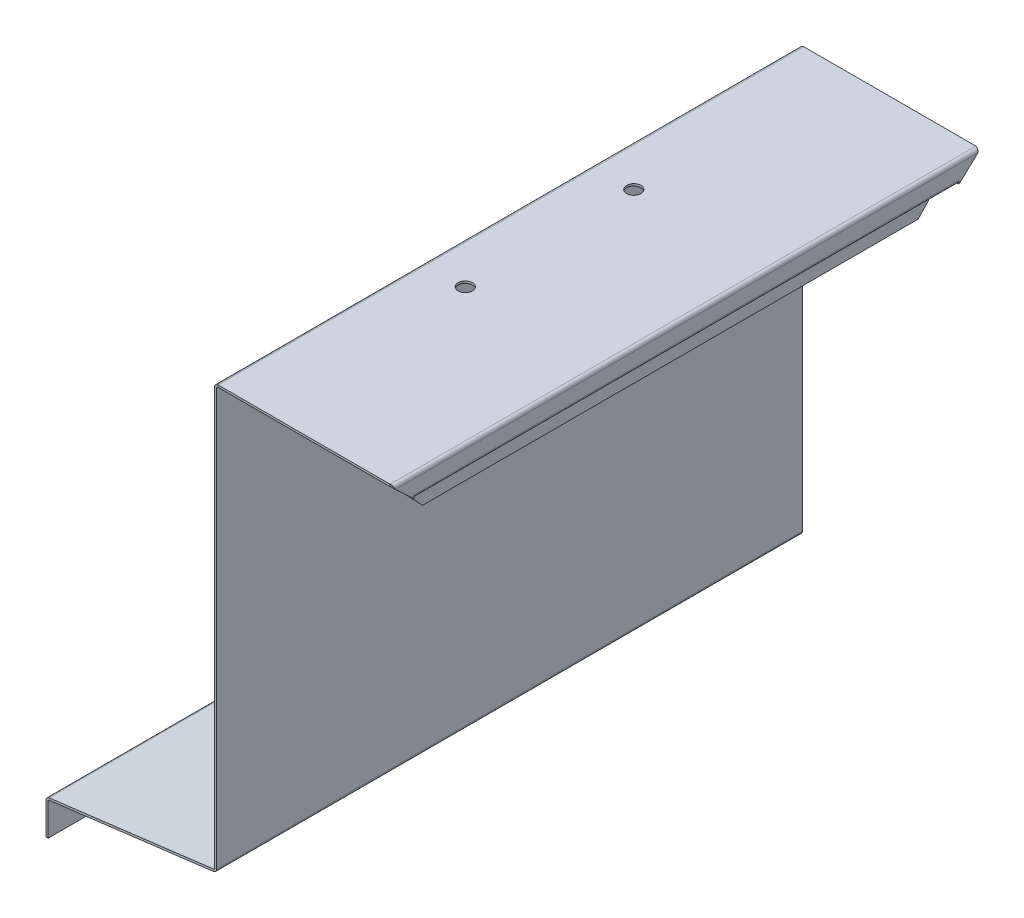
ISO-10303-21;
HEADER;
FILE_DESCRIPTION(('STEP AP214'),'2;1');
FILE_NAME('part.step','',(''),(''),'','','');
FILE_SCHEMA(('AUTOMOTIVE_DESIGN { 1 0 10303 214 1 1 1 1 }'));
ENDSEC;
DATA;
#1=APPLICATION_CONTEXT('core data for automotive mechanical design processes');
#2=APPLICATION_PROTOCOL_DEFINITION('international standard','automotive_design',2000,#1);
#3=PRODUCT_CONTEXT('',#1,'mechanical');
#4=PRODUCT('Part','Part','',(#3));
#5=PRODUCT_RELATED_PRODUCT_CATEGORY('part','',(#4));
#6=PRODUCT_DEFINITION_FORMATION('','',#4);
#7=PRODUCT_DEFINITION_CONTEXT('part definition',#1,'design');
#8=PRODUCT_DEFINITION('design','',#6,#7);
#9=PRODUCT_DEFINITION_SHAPE('','',#8);
#10=(LENGTH_UNIT() NAMED_UNIT(*) SI_UNIT(.MILLI.,.METRE.));
#11=(NAMED_UNIT(*) PLANE_ANGLE_UNIT() SI_UNIT($,.RADIAN.));
#12=(NAMED_UNIT(*) SI_UNIT($,.STERADIAN.) SOLID_ANGLE_UNIT());
#13=UNCERTAINTY_MEASURE_WITH_UNIT(LENGTH_MEASURE(1.E-05),#10,'distance_accuracy_value','');
#14=(GEOMETRIC_REPRESENTATION_CONTEXT(3) GLOBAL_UNCERTAINTY_ASSIGNED_CONTEXT((#13)) GLOBAL_UNIT_ASSIGNED_CONTEXT((#10,
#11,#12)) REPRESENTATION_CONTEXT('',''));
#15=CARTESIAN_POINT('',(0.,0.,0.));
#16=DIRECTION('',(0.,0.,1.));
#17=DIRECTION('',(1.,0.,0.));
#18=AXIS2_PLACEMENT_3D('',#15,#16,#17);
#19=CARTESIAN_POINT('',(126.,285.,-193.93));
#20=DIRECTION('',(0.,0.,1.));
#21=DIRECTION('',(1.,0.,0.));
#22=AXIS2_PLACEMENT_3D('',#19,#20,#21);
#23=PLANE('',#22);
#24=DIRECTION('',(0.,1.,0.));
#25=VECTOR('',#24,1.);
#26=CARTESIAN_POINT('',(117.,285.,-193.93));
#27=LINE('',#26,#25);
#28=CARTESIAN_POINT('',(117.,285.,-193.93));
#29=VERTEX_POINT('',#28);
#30=CARTESIAN_POINT('',(117.,286.5,-193.93));
#31=VERTEX_POINT('',#30);
#32=EDGE_CURVE('E313',#29,#31,#27,.T.);
#33=ORIENTED_EDGE('',*,*,#32,.T.);
#34=DIRECTION('',(-1.,0.,0.));
#35=VECTOR('',#34,1.);
#36=CARTESIAN_POINT('',(126.,286.5,-193.93));
#37=LINE('',#36,#35);
#38=CARTESIAN_POINT('',(125.,286.5,-193.93));
#39=VERTEX_POINT('',#38);
#40=EDGE_CURVE('E798',#31,#39,#37,.F.);
#41=ORIENTED_EDGE('',*,*,#40,.T.);
#42=DIRECTION('',(0.,1.,0.));
#43=VECTOR('',#42,1.);
#44=CARTESIAN_POINT('',(125.,285.,-193.93));
#45=LINE('',#44,#43);
#46=CARTESIAN_POINT('',(125.,285.,-193.93));
#47=VERTEX_POINT('',#46);
#48=EDGE_CURVE('E312',#39,#47,#45,.F.);
#49=ORIENTED_EDGE('',*,*,#48,.T.);
#50=DIRECTION('',(1.,0.,0.));
#51=VECTOR('',#50,1.);
#52=CARTESIAN_POINT('',(116.,285.,-193.93));
#53=LINE('',#52,#51);
#54=EDGE_CURVE('E802',#29,#47,#53,.T.);
#55=ORIENTED_EDGE('',*,*,#54,.F.);
#56=EDGE_LOOP('',(#33,#41,#49,#55));
#57=FACE_BOUND('',#56,.T.);
#58=ADVANCED_FACE('F54',(#57),#23,.F.);
#59=CARTESIAN_POINT('',(116.,285.,193.93));
#60=DIRECTION('',(0.,0.,-1.));
#61=DIRECTION('',(-1.,0.,0.));
#62=AXIS2_PLACEMENT_3D('',#59,#60,#61);
#63=PLANE('',#62);
#64=DIRECTION('',(0.,1.,0.));
#65=VECTOR('',#64,1.);
#66=CARTESIAN_POINT('',(117.,285.,193.93));
#67=LINE('',#66,#65);
#68=CARTESIAN_POINT('',(117.,285.,193.93));
#69=VERTEX_POINT('',#68);
#70=CARTESIAN_POINT('',(117.,286.5,193.93));
#71=VERTEX_POINT('',#70);
#72=EDGE_CURVE('E310',#69,#71,#67,.T.);
#73=ORIENTED_EDGE('',*,*,#72,.F.);
#74=DIRECTION('',(-1.,0.,0.));
#75=VECTOR('',#74,1.);
#76=CARTESIAN_POINT('',(116.,285.,193.93));
#77=LINE('',#76,#75);
#78=CARTESIAN_POINT('',(125.,285.,193.93));
#79=VERTEX_POINT('',#78);
#80=EDGE_CURVE('E349',#79,#69,#77,.T.);
#81=ORIENTED_EDGE('',*,*,#80,.F.);
#82=DIRECTION('',(0.,1.,0.));
#83=VECTOR('',#82,1.);
#84=CARTESIAN_POINT('',(125.,286.5,193.93));
#85=LINE('',#84,#83);
#86=CARTESIAN_POINT('',(125.,286.5,193.93));
#87=VERTEX_POINT('',#86);
#88=EDGE_CURVE('E792',#87,#79,#85,.F.);
#89=ORIENTED_EDGE('',*,*,#88,.F.);
#90=DIRECTION('',(1.,0.,0.));
#91=VECTOR('',#90,1.);
#92=CARTESIAN_POINT('',(116.,286.5,193.93));
#93=LINE('',#92,#91);
#94=EDGE_CURVE('E800',#87,#71,#93,.F.);
#95=ORIENTED_EDGE('',*,*,#94,.T.);
#96=EDGE_LOOP('',(#73,#81,#89,#95));
#97=FACE_BOUND('',#96,.T.);
#98=ADVANCED_FACE('F366',(#97),#63,.F.);
#99=CARTESIAN_POINT('',(116.,285.,-193.93));
#100=DIRECTION('',(0.,1.,0.));
#101=DIRECTION('',(-1.,0.,0.));
#102=AXIS2_PLACEMENT_3D('',#99,#100,#101);
#103=PLANE('',#102);
#104=DIRECTION('',(0.,0.,-1.));
#105=VECTOR('',#104,1.);
#106=CARTESIAN_POINT('',(117.,285.,-193.93));
#107=LINE('',#106,#105);
#108=EDGE_CURVE('E307',#29,#69,#107,.F.);
#109=ORIENTED_EDGE('',*,*,#108,.F.);
#110=ORIENTED_EDGE('',*,*,#54,.T.);
#111=DIRECTION('',(0.,0.,1.));
#112=VECTOR('',#111,1.);
#113=CARTESIAN_POINT('',(125.,285.,-193.93));
#114=LINE('',#113,#112);
#115=EDGE_CURVE('E795',#79,#47,#114,.F.);
#116=ORIENTED_EDGE('',*,*,#115,.F.);
#117=ORIENTED_EDGE('',*,*,#80,.T.);
#118=EDGE_LOOP('',(#109,#110,#116,#117));
#119=FACE_BOUND('',#118,.T.);
#120=ADVANCED_FACE('F356',(#119),#103,.F.);
#121=CARTESIAN_POINT('',(116.,286.5,-193.93));
#122=DIRECTION('',(0.,1.,0.));
#123=DIRECTION('',(-1.,0.,0.));
#124=AXIS2_PLACEMENT_3D('',#121,#122,#123);
#125=PLANE('',#124);
#126=ORIENTED_EDGE('',*,*,#40,.F.);
#127=DIRECTION('',(0.,0.,-1.));
#128=VECTOR('',#127,1.);
#129=CARTESIAN_POINT('',(117.,286.5,-193.93));
#130=LINE('',#129,#128);
#131=EDGE_CURVE('E263',#31,#71,#130,.F.);
#132=ORIENTED_EDGE('',*,*,#131,.T.);
#133=ORIENTED_EDGE('',*,*,#94,.F.);
#134=DIRECTION('',(0.,0.,1.));
#135=VECTOR('',#134,1.);
#136=CARTESIAN_POINT('',(125.,286.5,-193.93));
#137=LINE('',#136,#135);
#138=EDGE_CURVE('E790',#39,#87,#137,.T.);
#139=ORIENTED_EDGE('',*,*,#138,.F.);
#140=EDGE_LOOP('',(#126,#132,#133,#139));
#141=FACE_BOUND('',#140,.T.);
#142=ADVANCED_FACE('F365',(#141),#125,.T.);
#143=CARTESIAN_POINT('',(126.,285.,193.93));
#144=DIRECTION('',(0.,0.,-1.));
#145=DIRECTION('',(-1.,0.,0.));
#146=AXIS2_PLACEMENT_3D('',#143,#144,#145);
#147=PLANE('',#146);
#148=DIRECTION('',(0.,1.,0.));
#149=VECTOR('',#148,1.);
#150=CARTESIAN_POINT('',(126.,285.,193.93));
#151=LINE('',#150,#149);
#152=CARTESIAN_POINT('',(126.,285.,193.93));
#153=VERTEX_POINT('',#152);
#154=CARTESIAN_POINT('',(126.,285.208712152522,193.93));
#155=VERTEX_POINT('',#154);
#156=EDGE_CURVE('E765',#153,#155,#151,.T.);
#157=ORIENTED_EDGE('',*,*,#156,.T.);
#158=CARTESIAN_POINT('',(125.,287.5,193.93));
#159=DIRECTION('',(0.,0.,1.));
#160=DIRECTION('',(1.,0.,0.));
#161=AXIS2_PLACEMENT_3D('',#158,#159,#160);
#162=CIRCLE('',#161,2.5);
#163=CARTESIAN_POINT('',(127.5,287.5,193.93));
#164=VERTEX_POINT('',#163);
#165=EDGE_CURVE('E13',#155,#164,#162,.T.);
#166=ORIENTED_EDGE('',*,*,#165,.T.);
#167=DIRECTION('',(0.,1.,0.));
#168=VECTOR('',#167,1.);
#169=CARTESIAN_POINT('',(127.5,298.5,193.93));
#170=LINE('',#169,#168);
#171=CARTESIAN_POINT('',(127.5,285.,193.93));
#172=VERTEX_POINT('',#171);
#173=EDGE_CURVE('E756',#172,#164,#170,.T.);
#174=ORIENTED_EDGE('',*,*,#173,.F.);
#175=DIRECTION('',(-1.,0.,0.));
#176=VECTOR('',#175,1.);
#177=CARTESIAN_POINT('',(127.5,285.,193.93));
#178=LINE('',#177,#176);
#179=EDGE_CURVE('E472',#172,#153,#178,.T.);
#180=ORIENTED_EDGE('',*,*,#179,.T.);
#181=EDGE_LOOP('',(#157,#166,#174,#180));
#182=FACE_BOUND('',#181,.T.);
#183=ADVANCED_FACE('F370',(#182),#147,.T.);
#184=CARTESIAN_POINT('',(126.,287.5,-193.93));
#185=DIRECTION('',(0.,0.,1.));
#186=DIRECTION('',(1.,0.,0.));
#187=AXIS2_PLACEMENT_3D('',#184,#185,#186);
#188=PLANE('',#187);
#189=DIRECTION('',(0.,-1.,0.));
#190=VECTOR('',#189,1.);
#191=CARTESIAN_POINT('',(127.5,298.5,-193.93));
#192=LINE('',#191,#190);
#193=CARTESIAN_POINT('',(127.5,287.5,-193.93));
#194=VERTEX_POINT('',#193);
#195=CARTESIAN_POINT('',(127.5,285.,-193.93));
#196=VERTEX_POINT('',#195);
#197=EDGE_CURVE('E762',#194,#196,#192,.T.);
#198=ORIENTED_EDGE('',*,*,#197,.F.);
#199=CARTESIAN_POINT('',(125.,287.5,-193.93));
#200=DIRECTION('',(0.,0.,1.));
#201=DIRECTION('',(1.,0.,0.));
#202=AXIS2_PLACEMENT_3D('',#199,#200,#201);
#203=CIRCLE('',#202,2.5);
#204=CARTESIAN_POINT('',(126.,285.208712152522,-193.93));
#205=VERTEX_POINT('',#204);
#206=EDGE_CURVE('E782',#194,#205,#203,.F.);
#207=ORIENTED_EDGE('',*,*,#206,.T.);
#208=DIRECTION('',(0.,-1.,0.));
#209=VECTOR('',#208,1.);
#210=CARTESIAN_POINT('',(126.,287.5,-193.93));
#211=LINE('',#210,#209);
#212=CARTESIAN_POINT('',(126.,285.,-193.93));
#213=VERTEX_POINT('',#212);
#214=EDGE_CURVE('E769',#205,#213,#211,.T.);
#215=ORIENTED_EDGE('',*,*,#214,.T.);
#216=DIRECTION('',(-1.,0.,0.));
#217=VECTOR('',#216,1.);
#218=CARTESIAN_POINT('',(127.5,285.,-193.93));
#219=LINE('',#218,#217);
#220=EDGE_CURVE('E732',#196,#213,#219,.T.);
#221=ORIENTED_EDGE('',*,*,#220,.F.);
#222=EDGE_LOOP('',(#198,#207,#215,#221));
#223=FACE_BOUND('',#222,.T.);
#224=ADVANCED_FACE('F395',(#223),#188,.T.);
#225=CARTESIAN_POINT('',(127.5,298.5,208.5));
#226=DIRECTION('',(1.,0.,0.));
#227=DIRECTION('',(0.,1.,0.));
#228=AXIS2_PLACEMENT_3D('',#225,#226,#227);
#229=PLANE('',#228);
#230=DIRECTION('',(0.,0.679658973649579,0.733528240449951));
#231=VECTOR('',#230,1.);
#232=CARTESIAN_POINT('',(127.5,298.5,208.5));
#233=LINE('',#232,#231);
#234=CARTESIAN_POINT('',(127.5,297.5,207.420740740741));
#235=VERTEX_POINT('',#234);
#236=EDGE_CURVE('E735',#172,#235,#233,.T.);
#237=ORIENTED_EDGE('',*,*,#236,.F.);
#238=ORIENTED_EDGE('',*,*,#173,.T.);
#239=DIRECTION('',(0.,0.,1.));
#240=VECTOR('',#239,1.);
#241=CARTESIAN_POINT('',(127.5,287.5,193.93));
#242=LINE('',#241,#240);
#243=EDGE_CURVE('E781',#164,#194,#242,.F.);
#244=ORIENTED_EDGE('',*,*,#243,.T.);
#245=ORIENTED_EDGE('',*,*,#197,.T.);
#246=DIRECTION('',(0.,-0.679658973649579,0.733528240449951));
#247=VECTOR('',#246,1.);
#248=CARTESIAN_POINT('',(127.5,285.,-193.93));
#249=LINE('',#248,#247);
#250=CARTESIAN_POINT('',(127.5,297.5,-207.420740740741));
#251=VERTEX_POINT('',#250);
#252=EDGE_CURVE('E740',#251,#196,#249,.T.);
#253=ORIENTED_EDGE('',*,*,#252,.F.);
#254=DIRECTION('',(0.,0.,1.));
#255=VECTOR('',#254,1.);
#256=CARTESIAN_POINT('',(127.5,297.5,208.5));
#257=LINE('',#256,#255);
#258=EDGE_CURVE('E744',#251,#235,#257,.T.);
#259=ORIENTED_EDGE('',*,*,#258,.T.);
#260=EDGE_LOOP('',(#237,#238,#244,#245,#253,#259));
#261=FACE_BOUND('',#260,.T.);
#262=ADVANCED_FACE('F398',(#261),#229,.T.);
#263=CARTESIAN_POINT('',(126.,298.5,208.5));
#264=DIRECTION('',(1.,0.,0.));
#265=DIRECTION('',(0.,1.,0.));
#266=AXIS2_PLACEMENT_3D('',#263,#264,#265);
#267=PLANE('',#266);
#268=ORIENTED_EDGE('',*,*,#156,.F.);
#269=DIRECTION('',(0.,0.679658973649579,0.733528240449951));
#270=VECTOR('',#269,1.);
#271=CARTESIAN_POINT('',(126.,298.5,208.5));
#272=LINE('',#271,#270);
#273=CARTESIAN_POINT('',(126.,297.5,207.420740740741));
#274=VERTEX_POINT('',#273);
#275=EDGE_CURVE('E737',#153,#274,#272,.T.);
#276=ORIENTED_EDGE('',*,*,#275,.T.);
#277=DIRECTION('',(0.,0.,1.));
#278=VECTOR('',#277,1.);
#279=CARTESIAN_POINT('',(126.,297.5,-207.420740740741));
#280=LINE('',#279,#278);
#281=CARTESIAN_POINT('',(126.,297.5,-207.420740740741));
#282=VERTEX_POINT('',#281);
#283=EDGE_CURVE('E755',#282,#274,#280,.T.);
#284=ORIENTED_EDGE('',*,*,#283,.F.);
#285=DIRECTION('',(0.,-0.679658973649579,0.733528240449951));
#286=VECTOR('',#285,1.);
#287=CARTESIAN_POINT('',(126.,285.,-193.93));
#288=LINE('',#287,#286);
#289=EDGE_CURVE('E741',#282,#213,#288,.T.);
#290=ORIENTED_EDGE('',*,*,#289,.T.);
#291=ORIENTED_EDGE('',*,*,#214,.F.);
#292=CARTESIAN_POINT('',(126.,287.5,-193.93));
#293=VERTEX_POINT('',#292);
#294=EDGE_CURVE('E766',#293,#205,#211,.T.);
#295=ORIENTED_EDGE('',*,*,#294,.F.);
#296=DIRECTION('',(0.,0.,1.));
#297=VECTOR('',#296,1.);
#298=CARTESIAN_POINT('',(126.,287.5,193.93));
#299=LINE('',#298,#297);
#300=CARTESIAN_POINT('',(126.,287.5,193.93));
#301=VERTEX_POINT('',#300);
#302=EDGE_CURVE('E774',#301,#293,#299,.F.);
#303=ORIENTED_EDGE('',*,*,#302,.F.);
#304=EDGE_CURVE('E79',#155,#301,#151,.T.);
#305=ORIENTED_EDGE('',*,*,#304,.F.);
#306=EDGE_LOOP('',(#268,#276,#284,#290,#291,#295,#303,#305));
#307=FACE_BOUND('',#306,.T.);
#308=ADVANCED_FACE('F405',(#307),#267,.F.);
#309=CARTESIAN_POINT('',(1.5,297.5,208.5));
#310=DIRECTION('',(0.,0.,1.));
#311=DIRECTION('',(1.,0.,0.));
#312=AXIS2_PLACEMENT_3D('',#309,#310,#311);
#313=PLANE('',#312);
#314=DIRECTION('',(-1.,0.,0.));
#315=VECTOR('',#314,1.);
#316=CARTESIAN_POINT('',(0.,298.5,208.5));
#317=LINE('',#316,#315);
#318=CARTESIAN_POINT('',(125.,298.5,208.5));
#319=VERTEX_POINT('',#318);
#320=CARTESIAN_POINT('',(2.5,298.5,208.5));
#321=VERTEX_POINT('',#320);
#322=EDGE_CURVE('E497',#319,#321,#317,.T.);
#323=ORIENTED_EDGE('',*,*,#322,.F.);
#324=DIRECTION('',(0.,1.,0.));
#325=VECTOR('',#324,1.);
#326=CARTESIAN_POINT('',(125.,298.5,208.5));
#327=LINE('',#326,#325);
#328=CARTESIAN_POINT('',(125.,300.,208.5));
#329=VERTEX_POINT('',#328);
#330=EDGE_CURVE('E717',#319,#329,#327,.T.);
#331=ORIENTED_EDGE('',*,*,#330,.T.);
#332=DIRECTION('',(-1.,0.,0.));
#333=VECTOR('',#332,1.);
#334=CARTESIAN_POINT('',(0.,300.,208.5));
#335=LINE('',#334,#333);
#336=CARTESIAN_POINT('',(2.5,300.,208.5));
#337=VERTEX_POINT('',#336);
#338=EDGE_CURVE('E499',#329,#337,#335,.T.);
#339=ORIENTED_EDGE('',*,*,#338,.T.);
#340=DIRECTION('',(0.,-1.,0.));
#341=VECTOR('',#340,1.);
#342=CARTESIAN_POINT('',(2.5,300.,208.5));
#343=LINE('',#342,#341);
#344=EDGE_CURVE('E606',#337,#321,#343,.T.);
#345=ORIENTED_EDGE('',*,*,#344,.T.);
#346=EDGE_LOOP('',(#323,#331,#339,#345));
#347=FACE_BOUND('',#346,.T.);
#348=ADVANCED_FACE('F409',(#347),#313,.T.);
#349=CARTESIAN_POINT('',(0.,298.5,208.5));
#350=DIRECTION('',(0.,-1.,0.));
#351=DIRECTION('',(1.,0.,0.));
#352=AXIS2_PLACEMENT_3D('',#349,#350,#351);
#353=PLANE('',#352);
#354=CARTESIAN_POINT('',(30.,298.5,-60.));
#355=DIRECTION('',(0.,-1.,0.));
#356=DIRECTION('',(1.,0.,0.));
#357=AXIS2_PLACEMENT_3D('',#354,#355,#356);
#358=CIRCLE('',#357,5.09999999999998);
#359=CARTESIAN_POINT('',(35.1,298.5,-60.));
#360=VERTEX_POINT('',#359);
#361=EDGE_CURVE('E1396',#360,#360,#358,.F.);
#362=ORIENTED_EDGE('',*,*,#361,.T.);
#363=EDGE_LOOP('',(#362));
#364=FACE_BOUND('',#363,.T.);
#365=CARTESIAN_POINT('',(30.,298.5,60.));
#366=DIRECTION('',(0.,-1.,0.));
#367=DIRECTION('',(1.,0.,0.));
#368=AXIS2_PLACEMENT_3D('',#365,#366,#367);
#369=CIRCLE('',#368,5.09999999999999);
#370=CARTESIAN_POINT('',(35.1,298.5,60.));
#371=VERTEX_POINT('',#370);
#372=EDGE_CURVE('E1390',#371,#371,#369,.F.);
#373=ORIENTED_EDGE('',*,*,#372,.T.);
#374=EDGE_LOOP('',(#373));
#375=FACE_BOUND('',#374,.T.);
#376=DIRECTION('',(-1.,0.,0.));
#377=VECTOR('',#376,1.);
#378=CARTESIAN_POINT('',(0.,298.5,-208.5));
#379=LINE('',#378,#377);
#380=CARTESIAN_POINT('',(125.,298.5,-208.5));
#381=VERTEX_POINT('',#380);
#382=CARTESIAN_POINT('',(2.5,298.5,-208.5));
#383=VERTEX_POINT('',#382);
#384=EDGE_CURVE('E542',#381,#383,#379,.T.);
#385=ORIENTED_EDGE('',*,*,#384,.F.);
#386=DIRECTION('',(0.,0.,1.));
#387=VECTOR('',#386,1.);
#388=CARTESIAN_POINT('',(125.,298.5,208.5));
#389=LINE('',#388,#387);
#390=EDGE_CURVE('E471',#319,#381,#389,.F.);
#391=ORIENTED_EDGE('',*,*,#390,.F.);
#392=ORIENTED_EDGE('',*,*,#322,.T.);
#393=DIRECTION('',(0.,0.,-1.));
#394=VECTOR('',#393,1.);
#395=CARTESIAN_POINT('',(2.5,298.5,208.5));
#396=LINE('',#395,#394);
#397=EDGE_CURVE('E577',#321,#383,#396,.T.);
#398=ORIENTED_EDGE('',*,*,#397,.T.);
#399=EDGE_LOOP('',(#385,#391,#392,#398));
#400=FACE_BOUND('',#399,.T.);
#401=ADVANCED_FACE('F711',(#364,#375,#400),#353,.T.);
#402=CARTESIAN_POINT('',(0.,300.,208.5));
#403=DIRECTION('',(0.,-1.,0.));
#404=DIRECTION('',(1.,0.,0.));
#405=AXIS2_PLACEMENT_3D('',#402,#403,#404);
#406=PLANE('',#405);
#407=CARTESIAN_POINT('',(30.,300.,-60.));
#408=DIRECTION('',(0.,1.,0.));
#409=DIRECTION('',(-1.,0.,0.));
#410=AXIS2_PLACEMENT_3D('',#407,#408,#409);
#411=CIRCLE('',#410,5.09999999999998);
#412=CARTESIAN_POINT('',(24.9,300.,-60.));
#413=VERTEX_POINT('',#412);
#414=EDGE_CURVE('E1384',#413,#413,#411,.T.);
#415=ORIENTED_EDGE('',*,*,#414,.F.);
#416=EDGE_LOOP('',(#415));
#417=FACE_BOUND('',#416,.T.);
#418=CARTESIAN_POINT('',(30.,300.,60.));
#419=DIRECTION('',(0.,1.,0.));
#420=DIRECTION('',(-1.,0.,0.));
#421=AXIS2_PLACEMENT_3D('',#418,#419,#420);
#422=CIRCLE('',#421,5.09999999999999);
#423=CARTESIAN_POINT('',(24.9,300.,60.));
#424=VERTEX_POINT('',#423);
#425=EDGE_CURVE('E1387',#424,#424,#422,.T.);
#426=ORIENTED_EDGE('',*,*,#425,.F.);
#427=EDGE_LOOP('',(#426));
#428=FACE_BOUND('',#427,.T.);
#429=DIRECTION('',(0.,0.,1.));
#430=VECTOR('',#429,1.);
#431=CARTESIAN_POINT('',(125.,300.,208.5));
#432=LINE('',#431,#430);
#433=CARTESIAN_POINT('',(125.,300.,-208.5));
#434=VERTEX_POINT('',#433);
#435=EDGE_CURVE('E442',#329,#434,#432,.F.);
#436=ORIENTED_EDGE('',*,*,#435,.T.);
#437=DIRECTION('',(-1.,0.,0.));
#438=VECTOR('',#437,1.);
#439=CARTESIAN_POINT('',(0.,300.,-208.5));
#440=LINE('',#439,#438);
#441=CARTESIAN_POINT('',(2.5,300.,-208.5));
#442=VERTEX_POINT('',#441);
#443=EDGE_CURVE('E544',#434,#442,#440,.T.);
#444=ORIENTED_EDGE('',*,*,#443,.T.);
#445=DIRECTION('',(0.,0.,-1.));
#446=VECTOR('',#445,1.);
#447=CARTESIAN_POINT('',(2.5,300.,208.5));
#448=LINE('',#447,#446);
#449=EDGE_CURVE('E574',#337,#442,#448,.T.);
#450=ORIENTED_EDGE('',*,*,#449,.F.);
#451=ORIENTED_EDGE('',*,*,#338,.F.);
#452=EDGE_LOOP('',(#436,#444,#450,#451));
#453=FACE_BOUND('',#452,.T.);
#454=ADVANCED_FACE('F721',(#417,#428,#453),#406,.F.);
#455=CARTESIAN_POINT('',(-117.5,-17.2069555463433,-208.5));
#456=DIRECTION('',(0.,0.,1.));
#457=DIRECTION('',(1.,0.,0.));
#458=AXIS2_PLACEMENT_3D('',#455,#456,#457);
#459=PLANE('',#458);
#460=DIRECTION('',(0.,1.,0.));
#461=VECTOR('',#460,1.);
#462=CARTESIAN_POINT('',(125.,298.5,-208.5));
#463=LINE('',#462,#461);
#464=EDGE_CURVE('E521',#381,#434,#463,.T.);
#465=ORIENTED_EDGE('',*,*,#464,.F.);
#466=ORIENTED_EDGE('',*,*,#384,.T.);
#467=DIRECTION('',(0.,1.,0.));
#468=VECTOR('',#467,1.);
#469=CARTESIAN_POINT('',(2.5,298.5,-208.5));
#470=LINE('',#469,#468);
#471=EDGE_CURVE('E599',#383,#442,#470,.T.);
#472=ORIENTED_EDGE('',*,*,#471,.T.);
#473=ORIENTED_EDGE('',*,*,#443,.F.);
#474=EDGE_LOOP('',(#465,#466,#472,#473));
#475=FACE_BOUND('',#474,.T.);
#476=ADVANCED_FACE('F723',(#475),#459,.F.);
#477=CARTESIAN_POINT('',(-117.810086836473,-14.7262608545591,208.5));
#478=DIRECTION('',(0.,0.,1.));
#479=DIRECTION('',(1.,0.,0.));
#480=AXIS2_PLACEMENT_3D('',#477,#478,#479);
#481=PLANE('',#480);
#482=DIRECTION('',(0.124034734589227,-0.992277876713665,0.));
#483=VECTOR('',#482,1.);
#484=CARTESIAN_POINT('',(-117.810086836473,-14.7262608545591,208.5));
#485=LINE('',#484,#483);
#486=CARTESIAN_POINT('',(-117.810086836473,-14.7262608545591,208.5));
#487=VERTEX_POINT('',#486);
#488=CARTESIAN_POINT('',(-117.624034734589,-16.2146776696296,208.5));
#489=VERTEX_POINT('',#488);
#490=EDGE_CURVE('E58',#487,#489,#485,.T.);
#491=ORIENTED_EDGE('',*,*,#490,.F.);
#492=CARTESIAN_POINT('',(-117.5,-17.2069555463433,208.5));
#493=DIRECTION('',(0.,0.,1.));
#494=DIRECTION('',(1.,0.,0.));
#495=AXIS2_PLACEMENT_3D('',#492,#493,#494);
#496=CIRCLE('',#495,2.5);
#497=CARTESIAN_POINT('',(-120.,-17.2069555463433,208.5));
#498=VERTEX_POINT('',#497);
#499=EDGE_CURVE('E513',#487,#498,#496,.T.);
#500=ORIENTED_EDGE('',*,*,#499,.T.);
#501=DIRECTION('',(-1.,0.,0.));
#502=VECTOR('',#501,1.);
#503=CARTESIAN_POINT('',(-118.5,-17.2069555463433,208.5));
#504=LINE('',#503,#502);
#505=CARTESIAN_POINT('',(-118.5,-17.2069555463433,208.5));
#506=VERTEX_POINT('',#505);
#507=EDGE_CURVE('E620',#506,#498,#504,.T.);
#508=ORIENTED_EDGE('',*,*,#507,.F.);
#509=CARTESIAN_POINT('',(-117.5,-17.2069555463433,208.5));
#510=DIRECTION('',(0.,0.,1.));
#511=DIRECTION('',(1.,0.,0.));
#512=AXIS2_PLACEMENT_3D('',#509,#510,#511);
#513=CIRCLE('',#512,1.);
#514=EDGE_CURVE('E482',#489,#506,#513,.T.);
#515=ORIENTED_EDGE('',*,*,#514,.F.);
#516=EDGE_LOOP('',(#491,#500,#508,#515));
#517=FACE_BOUND('',#516,.T.);
#518=ADVANCED_FACE('F56',(#517),#481,.T.);
#519=CARTESIAN_POINT('',(-118.5,-17.2069555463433,208.5));
#520=DIRECTION('',(0.,0.,1.));
#521=DIRECTION('',(1.,0.,0.));
#522=AXIS2_PLACEMENT_3D('',#519,#520,#521);
#523=PLANE('',#522);
#524=DIRECTION('',(-0.992277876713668,-0.124034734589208,0.));
#525=VECTOR('',#524,1.);
#526=CARTESIAN_POINT('',(0.,0.,208.5));
#527=LINE('',#526,#525);
#528=CARTESIAN_POINT('',(-0.875965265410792,-0.109495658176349,208.5));
#529=VERTEX_POINT('',#528);
#530=EDGE_CURVE('E510',#529,#487,#527,.T.);
#531=ORIENTED_EDGE('',*,*,#530,.T.);
#532=ORIENTED_EDGE('',*,*,#490,.T.);
#533=DIRECTION('',(-0.992277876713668,-0.124034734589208,0.));
#534=VECTOR('',#533,1.);
#535=CARTESIAN_POINT('',(0.186052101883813,-1.4884168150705,208.5));
#536=LINE('',#535,#534);
#537=CARTESIAN_POINT('',(-0.689913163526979,-1.59791247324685,208.5));
#538=VERTEX_POINT('',#537);
#539=EDGE_CURVE('E485',#538,#489,#536,.T.);
#540=ORIENTED_EDGE('',*,*,#539,.F.);
#541=DIRECTION('',(-0.124034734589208,0.992277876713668,0.));
#542=VECTOR('',#541,1.);
#543=CARTESIAN_POINT('',(-0.689913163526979,-1.59791247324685,208.5));
#544=LINE('',#543,#542);
#545=EDGE_CURVE('E613',#538,#529,#544,.T.);
#546=ORIENTED_EDGE('',*,*,#545,.T.);
#547=EDGE_LOOP('',(#531,#532,#540,#546));
#548=FACE_BOUND('',#547,.T.);
#549=ADVANCED_FACE('F626',(#548),#523,.T.);
#550=CARTESIAN_POINT('',(-120.,-17.2069555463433,-208.5));
#551=DIRECTION('',(0.,0.,-1.));
#552=DIRECTION('',(-1.,0.,0.));
#553=AXIS2_PLACEMENT_3D('',#550,#551,#552);
#554=PLANE('',#553);
#555=DIRECTION('',(1.,0.,0.));
#556=VECTOR('',#555,1.);
#557=CARTESIAN_POINT('',(-120.,-17.2069555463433,-208.5));
#558=LINE('',#557,#556);
#559=CARTESIAN_POINT('',(-120.,-17.2069555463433,-208.5));
#560=VERTEX_POINT('',#559);
#561=CARTESIAN_POINT('',(-118.5,-17.2069555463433,-208.5));
#562=VERTEX_POINT('',#561);
#563=EDGE_CURVE('E619',#560,#562,#558,.T.);
#564=ORIENTED_EDGE('',*,*,#563,.F.);
#565=CARTESIAN_POINT('',(-117.5,-17.2069555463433,-208.5));
#566=DIRECTION('',(0.,0.,1.));
#567=DIRECTION('',(1.,0.,0.));
#568=AXIS2_PLACEMENT_3D('',#565,#566,#567);
#569=CIRCLE('',#568,2.5);
#570=CARTESIAN_POINT('',(-117.810086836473,-14.7262608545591,-208.5));
#571=VERTEX_POINT('',#570);
#572=EDGE_CURVE('E476',#571,#560,#569,.T.);
#573=ORIENTED_EDGE('',*,*,#572,.F.);
#574=DIRECTION('',(-0.124034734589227,0.992277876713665,0.));
#575=VECTOR('',#574,1.);
#576=CARTESIAN_POINT('',(-117.624034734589,-16.2146776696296,-208.5));
#577=LINE('',#576,#575);
#578=CARTESIAN_POINT('',(-117.624034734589,-16.2146776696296,-208.5));
#579=VERTEX_POINT('',#578);
#580=EDGE_CURVE('E617',#579,#571,#577,.T.);
#581=ORIENTED_EDGE('',*,*,#580,.F.);
#582=CARTESIAN_POINT('',(-117.5,-17.2069555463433,-208.5));
#583=DIRECTION('',(0.,0.,1.));
#584=DIRECTION('',(1.,0.,0.));
#585=AXIS2_PLACEMENT_3D('',#582,#583,#584);
#586=CIRCLE('',#585,1.);
#587=EDGE_CURVE('E527',#579,#562,#586,.T.);
#588=ORIENTED_EDGE('',*,*,#587,.T.);
#589=EDGE_LOOP('',(#564,#573,#581,#588));
#590=FACE_BOUND('',#589,.T.);
#591=ADVANCED_FACE('F698',(#590),#554,.T.);
#592=CARTESIAN_POINT('',(-117.624034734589,-16.2146776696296,-208.5));
#593=DIRECTION('',(0.,0.,-1.));
#594=DIRECTION('',(-1.,0.,0.));
#595=AXIS2_PLACEMENT_3D('',#592,#593,#594);
#596=PLANE('',#595);
#597=DIRECTION('',(0.,-1.,0.));
#598=VECTOR('',#597,1.);
#599=CARTESIAN_POINT('',(-120.,-15.,-208.5));
#600=LINE('',#599,#598);
#601=CARTESIAN_POINT('',(-120.,-40.,-208.5));
#602=VERTEX_POINT('',#601);
#603=EDGE_CURVE('E517',#560,#602,#600,.T.);
#604=ORIENTED_EDGE('',*,*,#603,.F.);
#605=ORIENTED_EDGE('',*,*,#563,.T.);
#606=DIRECTION('',(0.,1.,0.));
#607=VECTOR('',#606,1.);
#608=CARTESIAN_POINT('',(-118.5,-15.,-208.5));
#609=LINE('',#608,#607);
#610=CARTESIAN_POINT('',(-118.5,-40.,-208.5));
#611=VERTEX_POINT('',#610);
#612=EDGE_CURVE('E524',#562,#611,#609,.F.);
#613=ORIENTED_EDGE('',*,*,#612,.T.);
#614=DIRECTION('',(-1.,0.,0.));
#615=VECTOR('',#614,1.);
#616=CARTESIAN_POINT('',(-118.5,-40.,-208.5));
#617=LINE('',#616,#615);
#618=EDGE_CURVE('E520',#611,#602,#617,.T.);
#619=ORIENTED_EDGE('',*,*,#618,.T.);
#620=EDGE_LOOP('',(#604,#605,#613,#619));
#621=FACE_BOUND('',#620,.T.);
#622=ADVANCED_FACE('F1298',(#621),#596,.T.);
#623=CARTESIAN_POINT('',(0.,0.882782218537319,208.5));
#624=DIRECTION('',(0.,0.,1.));
#625=DIRECTION('',(1.,0.,0.));
#626=AXIS2_PLACEMENT_3D('',#623,#624,#625);
#627=PLANE('',#626);
#628=DIRECTION('',(1.,0.,0.));
#629=VECTOR('',#628,1.);
#630=CARTESIAN_POINT('',(0.,0.882782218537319,208.5));
#631=LINE('',#630,#629);
#632=CARTESIAN_POINT('',(0.,0.882782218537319,208.5));
#633=VERTEX_POINT('',#632);
#634=CARTESIAN_POINT('',(1.5,0.882782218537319,208.5));
#635=VERTEX_POINT('',#634);
#636=EDGE_CURVE('E615',#633,#635,#631,.T.);
#637=ORIENTED_EDGE('',*,*,#636,.F.);
#638=CARTESIAN_POINT('',(-1.,0.882782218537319,208.5));
#639=DIRECTION('',(0.,0.,-1.));
#640=DIRECTION('',(-1.,0.,0.));
#641=AXIS2_PLACEMENT_3D('',#638,#639,#640);
#642=CIRCLE('',#641,1.);
#643=EDGE_CURVE('E507',#633,#529,#642,.T.);
#644=ORIENTED_EDGE('',*,*,#643,.T.);
#645=ORIENTED_EDGE('',*,*,#545,.F.);
#646=CARTESIAN_POINT('',(-1.,0.882782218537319,208.5));
#647=DIRECTION('',(0.,0.,1.));
#648=DIRECTION('',(1.,0.,0.));
#649=AXIS2_PLACEMENT_3D('',#646,#647,#648);
#650=CIRCLE('',#649,2.5);
#651=EDGE_CURVE('E488',#635,#538,#650,.F.);
#652=ORIENTED_EDGE('',*,*,#651,.F.);
#653=EDGE_LOOP('',(#637,#644,#645,#652));
#654=FACE_BOUND('',#653,.T.);
#655=ADVANCED_FACE('F645',(#654),#627,.T.);
#656=CARTESIAN_POINT('',(-0.689913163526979,-1.59791247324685,208.5));
#657=DIRECTION('',(0.,0.,1.));
#658=DIRECTION('',(1.,0.,0.));
#659=AXIS2_PLACEMENT_3D('',#656,#657,#658);
#660=PLANE('',#659);
#661=DIRECTION('',(0.,-1.,0.));
#662=VECTOR('',#661,1.);
#663=CARTESIAN_POINT('',(0.,0.,208.5));
#664=LINE('',#663,#662);
#665=CARTESIAN_POINT('',(0.,297.5,208.5));
#666=VERTEX_POINT('',#665);
#667=EDGE_CURVE('E504',#666,#633,#664,.T.);
#668=ORIENTED_EDGE('',*,*,#667,.T.);
#669=ORIENTED_EDGE('',*,*,#636,.T.);
#670=DIRECTION('',(0.,1.,0.));
#671=VECTOR('',#670,1.);
#672=CARTESIAN_POINT('',(1.5,0.,208.5));
#673=LINE('',#672,#671);
#674=CARTESIAN_POINT('',(1.5,297.5,208.5));
#675=VERTEX_POINT('',#674);
#676=EDGE_CURVE('E491',#675,#635,#673,.F.);
#677=ORIENTED_EDGE('',*,*,#676,.F.);
#678=DIRECTION('',(-1.,0.,0.));
#679=VECTOR('',#678,1.);
#680=CARTESIAN_POINT('',(1.5,297.5,208.5));
#681=LINE('',#680,#679);
#682=EDGE_CURVE('E604',#675,#666,#681,.T.);
#683=ORIENTED_EDGE('',*,*,#682,.T.);
#684=EDGE_LOOP('',(#668,#669,#677,#683));
#685=FACE_BOUND('',#684,.T.);
#686=ADVANCED_FACE('F652',(#685),#660,.T.);
#687=CARTESIAN_POINT('',(-0.875965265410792,-0.109495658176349,-208.5));
#688=DIRECTION('',(0.,0.,-1.));
#689=DIRECTION('',(-1.,0.,0.));
#690=AXIS2_PLACEMENT_3D('',#687,#688,#689);
#691=PLANE('',#690);
#692=DIRECTION('',(0.124034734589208,-0.992277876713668,0.));
#693=VECTOR('',#692,1.);
#694=CARTESIAN_POINT('',(-0.875965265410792,-0.109495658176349,-208.5));
#695=LINE('',#694,#693);
#696=CARTESIAN_POINT('',(-0.875965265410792,-0.109495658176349,-208.5));
#697=VERTEX_POINT('',#696);
#698=CARTESIAN_POINT('',(-0.689913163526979,-1.59791247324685,-208.5));
#699=VERTEX_POINT('',#698);
#700=EDGE_CURVE('E611',#697,#699,#695,.T.);
#701=ORIENTED_EDGE('',*,*,#700,.F.);
#702=CARTESIAN_POINT('',(-1.,0.882782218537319,-208.5));
#703=DIRECTION('',(0.,0.,-1.));
#704=DIRECTION('',(-1.,0.,0.));
#705=AXIS2_PLACEMENT_3D('',#702,#703,#704);
#706=CIRCLE('',#705,1.);
#707=CARTESIAN_POINT('',(0.,0.882782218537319,-208.5));
#708=VERTEX_POINT('',#707);
#709=EDGE_CURVE('E552',#708,#697,#706,.T.);
#710=ORIENTED_EDGE('',*,*,#709,.F.);
#711=DIRECTION('',(-1.,0.,0.));
#712=VECTOR('',#711,1.);
#713=CARTESIAN_POINT('',(1.5,0.882782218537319,-208.5));
#714=LINE('',#713,#712);
#715=CARTESIAN_POINT('',(1.5,0.882782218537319,-208.5));
#716=VERTEX_POINT('',#715);
#717=EDGE_CURVE('E609',#716,#708,#714,.T.);
#718=ORIENTED_EDGE('',*,*,#717,.F.);
#719=CARTESIAN_POINT('',(-1.,0.882782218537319,-208.5));
#720=DIRECTION('',(0.,0.,1.));
#721=DIRECTION('',(1.,0.,0.));
#722=AXIS2_PLACEMENT_3D('',#719,#720,#721);
#723=CIRCLE('',#722,2.5);
#724=EDGE_CURVE('E533',#716,#699,#723,.F.);
#725=ORIENTED_EDGE('',*,*,#724,.T.);
#726=EDGE_LOOP('',(#701,#710,#718,#725));
#727=FACE_BOUND('',#726,.T.);
#728=ADVANCED_FACE('F702',(#727),#691,.T.);
#729=CARTESIAN_POINT('',(1.5,0.882782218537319,-208.5));
#730=DIRECTION('',(0.,0.,-1.));
#731=DIRECTION('',(-1.,0.,0.));
#732=AXIS2_PLACEMENT_3D('',#729,#730,#731);
#733=PLANE('',#732);
#734=DIRECTION('',(-0.992277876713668,-0.124034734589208,0.));
#735=VECTOR('',#734,1.);
#736=CARTESIAN_POINT('',(0.,0.,-208.5));
#737=LINE('',#736,#735);
#738=EDGE_CURVE('E555',#697,#571,#737,.T.);
#739=ORIENTED_EDGE('',*,*,#738,.F.);
#740=ORIENTED_EDGE('',*,*,#700,.T.);
#741=DIRECTION('',(-0.992277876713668,-0.124034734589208,0.));
#742=VECTOR('',#741,1.);
#743=CARTESIAN_POINT('',(0.186052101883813,-1.4884168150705,-208.5));
#744=LINE('',#743,#742);
#745=EDGE_CURVE('E530',#699,#579,#744,.T.);
#746=ORIENTED_EDGE('',*,*,#745,.T.);
#747=ORIENTED_EDGE('',*,*,#580,.T.);
#748=EDGE_LOOP('',(#739,#740,#746,#747));
#749=FACE_BOUND('',#748,.T.);
#750=ADVANCED_FACE('F700',(#749),#733,.T.);
#751=CARTESIAN_POINT('',(2.5,300.,208.5));
#752=DIRECTION('',(0.,0.,1.));
#753=DIRECTION('',(1.,0.,0.));
#754=AXIS2_PLACEMENT_3D('',#751,#752,#753);
#755=PLANE('',#754);
#756=ORIENTED_EDGE('',*,*,#344,.F.);
#757=CARTESIAN_POINT('',(2.5,297.5,208.5));
#758=DIRECTION('',(0.,0.,1.));
#759=DIRECTION('',(1.,0.,0.));
#760=AXIS2_PLACEMENT_3D('',#757,#758,#759);
#761=CIRCLE('',#760,2.5);
#762=EDGE_CURVE('E501',#337,#666,#761,.T.);
#763=ORIENTED_EDGE('',*,*,#762,.T.);
#764=ORIENTED_EDGE('',*,*,#682,.F.);
#765=CARTESIAN_POINT('',(2.5,297.5,208.5));
#766=DIRECTION('',(0.,0.,1.));
#767=DIRECTION('',(1.,0.,0.));
#768=AXIS2_PLACEMENT_3D('',#765,#766,#767);
#769=CIRCLE('',#768,1.);
#770=EDGE_CURVE('E494',#321,#675,#769,.T.);
#771=ORIENTED_EDGE('',*,*,#770,.F.);
#772=EDGE_LOOP('',(#756,#763,#764,#771));
#773=FACE_BOUND('',#772,.T.);
#774=ADVANCED_FACE('F660',(#773),#755,.T.);
#775=CARTESIAN_POINT('',(0.,297.5,-208.5));
#776=DIRECTION('',(0.,0.,-1.));
#777=DIRECTION('',(-1.,0.,0.));
#778=AXIS2_PLACEMENT_3D('',#775,#776,#777);
#779=PLANE('',#778);
#780=DIRECTION('',(1.,0.,0.));
#781=VECTOR('',#780,1.);
#782=CARTESIAN_POINT('',(0.,297.5,-208.5));
#783=LINE('',#782,#781);
#784=CARTESIAN_POINT('',(0.,297.5,-208.5));
#785=VERTEX_POINT('',#784);
#786=CARTESIAN_POINT('',(1.5,297.5,-208.5));
#787=VERTEX_POINT('',#786);
#788=EDGE_CURVE('E602',#785,#787,#783,.T.);
#789=ORIENTED_EDGE('',*,*,#788,.F.);
#790=CARTESIAN_POINT('',(2.5,297.5,-208.5));
#791=DIRECTION('',(0.,0.,1.));
#792=DIRECTION('',(1.,0.,0.));
#793=AXIS2_PLACEMENT_3D('',#790,#791,#792);
#794=CIRCLE('',#793,2.5);
#795=EDGE_CURVE('E546',#442,#785,#794,.T.);
#796=ORIENTED_EDGE('',*,*,#795,.F.);
#797=ORIENTED_EDGE('',*,*,#471,.F.);
#798=CARTESIAN_POINT('',(2.5,297.5,-208.5));
#799=DIRECTION('',(0.,0.,1.));
#800=DIRECTION('',(1.,0.,0.));
#801=AXIS2_PLACEMENT_3D('',#798,#799,#800);
#802=CIRCLE('',#801,1.);
#803=EDGE_CURVE('E539',#383,#787,#802,.T.);
#804=ORIENTED_EDGE('',*,*,#803,.T.);
#805=EDGE_LOOP('',(#789,#796,#797,#804));
#806=FACE_BOUND('',#805,.T.);
#807=ADVANCED_FACE('F707',(#806),#779,.T.);
#808=CARTESIAN_POINT('',(2.5,298.5,-208.5));
#809=DIRECTION('',(0.,0.,-1.));
#810=DIRECTION('',(-1.,0.,0.));
#811=AXIS2_PLACEMENT_3D('',#808,#809,#810);
#812=PLANE('',#811);
#813=DIRECTION('',(0.,-1.,0.));
#814=VECTOR('',#813,1.);
#815=CARTESIAN_POINT('',(0.,0.,-208.5));
#816=LINE('',#815,#814);
#817=EDGE_CURVE('E549',#785,#708,#816,.T.);
#818=ORIENTED_EDGE('',*,*,#817,.F.);
#819=ORIENTED_EDGE('',*,*,#788,.T.);
#820=DIRECTION('',(0.,1.,0.));
#821=VECTOR('',#820,1.);
#822=CARTESIAN_POINT('',(1.5,0.,-208.5));
#823=LINE('',#822,#821);
#824=EDGE_CURVE('E536',#787,#716,#823,.F.);
#825=ORIENTED_EDGE('',*,*,#824,.T.);
#826=ORIENTED_EDGE('',*,*,#717,.T.);
#827=EDGE_LOOP('',(#818,#819,#825,#826));
#828=FACE_BOUND('',#827,.T.);
#829=ADVANCED_FACE('F704',(#828),#812,.T.);
#830=CARTESIAN_POINT('',(-120.,-15.,208.5));
#831=DIRECTION('',(1.,0.,0.));
#832=DIRECTION('',(0.,0.,-1.));
#833=AXIS2_PLACEMENT_3D('',#830,#831,#832);
#834=PLANE('',#833);
#835=ORIENTED_EDGE('',*,*,#603,.T.);
#836=DIRECTION('',(0.,0.,-1.));
#837=VECTOR('',#836,1.);
#838=CARTESIAN_POINT('',(-120.,-40.,208.5));
#839=LINE('',#838,#837);
#840=CARTESIAN_POINT('',(-120.,-40.,208.5));
#841=VERTEX_POINT('',#840);
#842=EDGE_CURVE('E597',#841,#602,#839,.T.);
#843=ORIENTED_EDGE('',*,*,#842,.F.);
#844=DIRECTION('',(0.,-1.,0.));
#845=VECTOR('',#844,1.);
#846=CARTESIAN_POINT('',(-120.,-15.,208.5));
#847=LINE('',#846,#845);
#848=EDGE_CURVE('E473',#498,#841,#847,.T.);
#849=ORIENTED_EDGE('',*,*,#848,.F.);
#850=DIRECTION('',(0.,0.,-1.));
#851=VECTOR('',#850,1.);
#852=CARTESIAN_POINT('',(-120.,-17.2069555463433,208.5));
#853=LINE('',#852,#851);
#854=EDGE_CURVE('E516',#498,#560,#853,.T.);
#855=ORIENTED_EDGE('',*,*,#854,.T.);
#856=EDGE_LOOP('',(#835,#843,#849,#855));
#857=FACE_BOUND('',#856,.T.);
#858=ADVANCED_FACE('F689',(#857),#834,.F.);
#859=CARTESIAN_POINT('',(-118.5,-40.,208.5));
#860=DIRECTION('',(0.,-1.,0.));
#861=DIRECTION('',(0.,0.,-1.));
#862=AXIS2_PLACEMENT_3D('',#859,#860,#861);
#863=PLANE('',#862);
#864=ORIENTED_EDGE('',*,*,#618,.F.);
#865=DIRECTION('',(0.,0.,-1.));
#866=VECTOR('',#865,1.);
#867=CARTESIAN_POINT('',(-118.5,-40.,208.5));
#868=LINE('',#867,#866);
#869=CARTESIAN_POINT('',(-118.5,-40.,208.5));
#870=VERTEX_POINT('',#869);
#871=EDGE_CURVE('E595',#870,#611,#868,.T.);
#872=ORIENTED_EDGE('',*,*,#871,.F.);
#873=DIRECTION('',(-1.,0.,0.));
#874=VECTOR('',#873,1.);
#875=CARTESIAN_POINT('',(-118.5,-40.,208.5));
#876=LINE('',#875,#874);
#877=EDGE_CURVE('E475',#870,#841,#876,.T.);
#878=ORIENTED_EDGE('',*,*,#877,.T.);
#879=ORIENTED_EDGE('',*,*,#842,.T.);
#880=EDGE_LOOP('',(#864,#872,#878,#879));
#881=FACE_BOUND('',#880,.T.);
#882=ADVANCED_FACE('F1219',(#881),#863,.T.);
#883=CARTESIAN_POINT('',(-118.5,-15.,208.5));
#884=DIRECTION('',(1.,0.,0.));
#885=DIRECTION('',(0.,0.,-1.));
#886=AXIS2_PLACEMENT_3D('',#883,#884,#885);
#887=PLANE('',#886);
#888=ORIENTED_EDGE('',*,*,#612,.F.);
#889=DIRECTION('',(0.,0.,-1.));
#890=VECTOR('',#889,1.);
#891=CARTESIAN_POINT('',(-118.5,-17.2069555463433,208.5));
#892=LINE('',#891,#890);
#893=EDGE_CURVE('E592',#506,#562,#892,.T.);
#894=ORIENTED_EDGE('',*,*,#893,.F.);
#895=DIRECTION('',(0.,1.,0.));
#896=VECTOR('',#895,1.);
#897=CARTESIAN_POINT('',(-118.5,-15.,208.5));
#898=LINE('',#897,#896);
#899=EDGE_CURVE('E479',#506,#870,#898,.F.);
#900=ORIENTED_EDGE('',*,*,#899,.T.);
#901=ORIENTED_EDGE('',*,*,#871,.T.);
#902=EDGE_LOOP('',(#888,#894,#900,#901));
#903=FACE_BOUND('',#902,.T.);
#904=ADVANCED_FACE('F694',(#903),#887,.T.);
#905=CARTESIAN_POINT('',(-117.5,-17.2069555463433,208.5));
#906=DIRECTION('',(0.,0.,-1.));
#907=DIRECTION('',(-1.,0.,0.));
#908=AXIS2_PLACEMENT_3D('',#905,#906,#907);
#909=CYLINDRICAL_SURFACE('',#908,1.);
#910=ORIENTED_EDGE('',*,*,#587,.F.);
#911=DIRECTION('',(0.,0.,-1.));
#912=VECTOR('',#911,1.);
#913=CARTESIAN_POINT('',(-117.624034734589,-16.2146776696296,208.5));
#914=LINE('',#913,#912);
#915=EDGE_CURVE('E589',#489,#579,#914,.T.);
#916=ORIENTED_EDGE('',*,*,#915,.F.);
#917=ORIENTED_EDGE('',*,*,#514,.T.);
#918=ORIENTED_EDGE('',*,*,#893,.T.);
#919=EDGE_LOOP('',(#910,#916,#917,#918));
#920=FACE_BOUND('',#919,.T.);
#921=ADVANCED_FACE('F633',(#920),#909,.F.);
#922=CARTESIAN_POINT('',(0.186052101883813,-1.4884168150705,208.5));
#923=DIRECTION('',(0.124034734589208,-0.992277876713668,0.));
#924=DIRECTION('',(0.992277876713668,0.124034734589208,0.));
#925=AXIS2_PLACEMENT_3D('',#922,#923,#924);
#926=PLANE('',#925);
#927=ORIENTED_EDGE('',*,*,#745,.F.);
#928=DIRECTION('',(0.,0.,-1.));
#929=VECTOR('',#928,1.);
#930=CARTESIAN_POINT('',(-0.689913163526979,-1.59791247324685,208.5));
#931=LINE('',#930,#929);
#932=EDGE_CURVE('E586',#538,#699,#931,.T.);
#933=ORIENTED_EDGE('',*,*,#932,.F.);
#934=ORIENTED_EDGE('',*,*,#539,.T.);
#935=ORIENTED_EDGE('',*,*,#915,.T.);
#936=EDGE_LOOP('',(#927,#933,#934,#935));
#937=FACE_BOUND('',#936,.T.);
#938=ADVANCED_FACE('F638',(#937),#926,.T.);
#939=CARTESIAN_POINT('',(-1.,0.882782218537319,208.5));
#940=DIRECTION('',(0.,0.,-1.));
#941=DIRECTION('',(-1.,0.,0.));
#942=AXIS2_PLACEMENT_3D('',#939,#940,#941);
#943=CYLINDRICAL_SURFACE('',#942,2.5);
#944=ORIENTED_EDGE('',*,*,#724,.F.);
#945=DIRECTION('',(0.,0.,-1.));
#946=VECTOR('',#945,1.);
#947=CARTESIAN_POINT('',(1.5,0.882782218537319,208.5));
#948=LINE('',#947,#946);
#949=EDGE_CURVE('E583',#635,#716,#948,.T.);
#950=ORIENTED_EDGE('',*,*,#949,.F.);
#951=ORIENTED_EDGE('',*,*,#651,.T.);
#952=ORIENTED_EDGE('',*,*,#932,.T.);
#953=EDGE_LOOP('',(#944,#950,#951,#952));
#954=FACE_BOUND('',#953,.T.);
#955=ADVANCED_FACE('F641',(#954),#943,.T.);
#956=CARTESIAN_POINT('',(1.5,0.,208.5));
#957=DIRECTION('',(1.,0.,0.));
#958=DIRECTION('',(0.,0.,-1.));
#959=AXIS2_PLACEMENT_3D('',#956,#957,#958);
#960=PLANE('',#959);
#961=ORIENTED_EDGE('',*,*,#824,.F.);
#962=DIRECTION('',(0.,0.,-1.));
#963=VECTOR('',#962,1.);
#964=CARTESIAN_POINT('',(1.5,297.5,208.5));
#965=LINE('',#964,#963);
#966=EDGE_CURVE('E580',#675,#787,#965,.T.);
#967=ORIENTED_EDGE('',*,*,#966,.F.);
#968=ORIENTED_EDGE('',*,*,#676,.T.);
#969=ORIENTED_EDGE('',*,*,#949,.T.);
#970=EDGE_LOOP('',(#961,#967,#968,#969));
#971=FACE_BOUND('',#970,.T.);
#972=ADVANCED_FACE('F650',(#971),#960,.T.);
#973=CARTESIAN_POINT('',(2.5,297.5,208.5));
#974=DIRECTION('',(0.,0.,-1.));
#975=DIRECTION('',(-1.,0.,0.));
#976=AXIS2_PLACEMENT_3D('',#973,#974,#975);
#977=CYLINDRICAL_SURFACE('',#976,1.);
#978=ORIENTED_EDGE('',*,*,#803,.F.);
#979=ORIENTED_EDGE('',*,*,#397,.F.);
#980=ORIENTED_EDGE('',*,*,#770,.T.);
#981=ORIENTED_EDGE('',*,*,#966,.T.);
#982=EDGE_LOOP('',(#978,#979,#980,#981));
#983=FACE_BOUND('',#982,.T.);
#984=ADVANCED_FACE('F657',(#983),#977,.F.);
#985=CARTESIAN_POINT('',(2.5,297.5,208.5));
#986=DIRECTION('',(0.,0.,-1.));
#987=DIRECTION('',(-1.,0.,0.));
#988=AXIS2_PLACEMENT_3D('',#985,#986,#987);
#989=CYLINDRICAL_SURFACE('',#988,2.5);
#990=ORIENTED_EDGE('',*,*,#795,.T.);
#991=DIRECTION('',(0.,0.,-1.));
#992=VECTOR('',#991,1.);
#993=CARTESIAN_POINT('',(0.,297.5,208.5));
#994=LINE('',#993,#992);
#995=EDGE_CURVE('E571',#666,#785,#994,.T.);
#996=ORIENTED_EDGE('',*,*,#995,.F.);
#997=ORIENTED_EDGE('',*,*,#762,.F.);
#998=ORIENTED_EDGE('',*,*,#449,.T.);
#999=EDGE_LOOP('',(#990,#996,#997,#998));
#1000=FACE_BOUND('',#999,.T.);
#1001=ADVANCED_FACE('F666',(#1000),#989,.T.);
#1002=CARTESIAN_POINT('',(0.,0.,208.5));
#1003=DIRECTION('',(1.,0.,0.));
#1004=DIRECTION('',(0.,0.,-1.));
#1005=AXIS2_PLACEMENT_3D('',#1002,#1003,#1004);
#1006=PLANE('',#1005);
#1007=ORIENTED_EDGE('',*,*,#817,.T.);
#1008=DIRECTION('',(0.,0.,-1.));
#1009=VECTOR('',#1008,1.);
#1010=CARTESIAN_POINT('',(0.,0.882782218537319,208.5));
#1011=LINE('',#1010,#1009);
#1012=EDGE_CURVE('E568',#633,#708,#1011,.T.);
#1013=ORIENTED_EDGE('',*,*,#1012,.F.);
#1014=ORIENTED_EDGE('',*,*,#667,.F.);
#1015=ORIENTED_EDGE('',*,*,#995,.T.);
#1016=EDGE_LOOP('',(#1007,#1013,#1014,#1015));
#1017=FACE_BOUND('',#1016,.T.);
#1018=ADVANCED_FACE('F671',(#1017),#1006,.F.);
#1019=CARTESIAN_POINT('',(-1.,0.882782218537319,208.5));
#1020=DIRECTION('',(0.,0.,-1.));
#1021=DIRECTION('',(-1.,0.,0.));
#1022=AXIS2_PLACEMENT_3D('',#1019,#1020,#1021);
#1023=CYLINDRICAL_SURFACE('',#1022,1.);
#1024=ORIENTED_EDGE('',*,*,#709,.T.);
#1025=DIRECTION('',(0.,0.,-1.));
#1026=VECTOR('',#1025,1.);
#1027=CARTESIAN_POINT('',(-0.875965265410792,-0.109495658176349,208.5));
#1028=LINE('',#1027,#1026);
#1029=EDGE_CURVE('E565',#529,#697,#1028,.T.);
#1030=ORIENTED_EDGE('',*,*,#1029,.F.);
#1031=ORIENTED_EDGE('',*,*,#643,.F.);
#1032=ORIENTED_EDGE('',*,*,#1012,.T.);
#1033=EDGE_LOOP('',(#1024,#1030,#1031,#1032));
#1034=FACE_BOUND('',#1033,.T.);
#1035=ADVANCED_FACE('F676',(#1034),#1023,.F.);
#1036=CARTESIAN_POINT('',(0.,0.,208.5));
#1037=DIRECTION('',(0.124034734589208,-0.992277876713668,0.));
#1038=DIRECTION('',(0.992277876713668,0.124034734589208,0.));
#1039=AXIS2_PLACEMENT_3D('',#1036,#1037,#1038);
#1040=PLANE('',#1039);
#1041=ORIENTED_EDGE('',*,*,#738,.T.);
#1042=DIRECTION('',(0.,0.,-1.));
#1043=VECTOR('',#1042,1.);
#1044=CARTESIAN_POINT('',(-117.810086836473,-14.7262608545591,208.5));
#1045=LINE('',#1044,#1043);
#1046=EDGE_CURVE('E562',#487,#571,#1045,.T.);
#1047=ORIENTED_EDGE('',*,*,#1046,.F.);
#1048=ORIENTED_EDGE('',*,*,#530,.F.);
#1049=ORIENTED_EDGE('',*,*,#1029,.T.);
#1050=EDGE_LOOP('',(#1041,#1047,#1048,#1049));
#1051=FACE_BOUND('',#1050,.T.);
#1052=ADVANCED_FACE('F679',(#1051),#1040,.F.);
#1053=CARTESIAN_POINT('',(-117.5,-17.2069555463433,208.5));
#1054=DIRECTION('',(0.,0.,-1.));
#1055=DIRECTION('',(-1.,0.,0.));
#1056=AXIS2_PLACEMENT_3D('',#1053,#1054,#1055);
#1057=CYLINDRICAL_SURFACE('',#1056,2.5);
#1058=ORIENTED_EDGE('',*,*,#572,.T.);
#1059=ORIENTED_EDGE('',*,*,#854,.F.);
#1060=ORIENTED_EDGE('',*,*,#499,.F.);
#1061=ORIENTED_EDGE('',*,*,#1046,.T.);
#1062=EDGE_LOOP('',(#1058,#1059,#1060,#1061));
#1063=FACE_BOUND('',#1062,.T.);
#1064=ADVANCED_FACE('F684',(#1063),#1057,.T.);
#1065=CARTESIAN_POINT('',(-117.5,-17.2069555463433,208.5));
#1066=DIRECTION('',(0.,0.,1.));
#1067=DIRECTION('',(1.,0.,0.));
#1068=AXIS2_PLACEMENT_3D('',#1065,#1066,#1067);
#1069=PLANE('',#1068);
#1070=ORIENTED_EDGE('',*,*,#848,.T.);
#1071=ORIENTED_EDGE('',*,*,#877,.F.);
#1072=ORIENTED_EDGE('',*,*,#899,.F.);
#1073=ORIENTED_EDGE('',*,*,#507,.T.);
#1074=EDGE_LOOP('',(#1070,#1071,#1072,#1073));
#1075=FACE_BOUND('',#1074,.T.);
#1076=ADVANCED_FACE('F457',(#1075),#1069,.T.);
#1077=CARTESIAN_POINT('',(125.,300.015,-208.5));
#1078=CARTESIAN_POINT('',(125.329267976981,300.015,-208.410046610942));
#1079=CARTESIAN_POINT('',(125.658295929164,299.949541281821,-208.32012345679));
#1080=CARTESIAN_POINT('',(126.266601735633,299.697572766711,-208.14024691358));
#1081=CARTESIAN_POINT('',(126.545585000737,299.511162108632,-208.050308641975));
#1082=CARTESIAN_POINT('',(127.011162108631,299.045585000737,-207.870432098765));
#1083=CARTESIAN_POINT('',(127.197572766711,298.766601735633,-207.780493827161));
#1084=CARTESIAN_POINT('',(127.449541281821,298.158295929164,-207.600617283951));
#1085=CARTESIAN_POINT('',(127.515,297.829267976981,-207.510694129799));
#1086=CARTESIAN_POINT('',(127.515,297.5,-207.420740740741));
#1087=CARTESIAN_POINT('',(125.,300.,-208.5));
#1088=CARTESIAN_POINT('',(125.32730409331,300.,-208.410046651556));
#1089=CARTESIAN_POINT('',(125.654369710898,299.934931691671,-208.32012345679));
#1090=CARTESIAN_POINT('',(126.259047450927,299.684465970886,-208.14024691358));
#1091=CARTESIAN_POINT('',(126.536366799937,299.499167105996,-208.050308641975));
#1092=CARTESIAN_POINT('',(126.999167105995,299.036366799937,-207.870432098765));
#1093=CARTESIAN_POINT('',(127.184465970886,298.759047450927,-207.780493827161));
#1094=CARTESIAN_POINT('',(127.434931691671,298.154369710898,-207.600617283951));
#1095=CARTESIAN_POINT('',(127.5,297.82730409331,-207.510694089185));
#1096=CARTESIAN_POINT('',(127.5,297.5,-207.420740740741));
#1097=CARTESIAN_POINT('',(125.,298.5,-208.5));
#1098=CARTESIAN_POINT('',(125.130915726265,298.5,-208.410050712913));
#1099=CARTESIAN_POINT('',(125.261747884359,298.473972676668,-208.32012345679));
#1100=CARTESIAN_POINT('',(125.503618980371,298.373786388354,-208.14024691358));
#1101=CARTESIAN_POINT('',(125.614546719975,298.299666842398,-208.050308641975));
#1102=CARTESIAN_POINT('',(125.799666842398,298.114546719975,-207.870432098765));
#1103=CARTESIAN_POINT('',(125.873786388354,298.003618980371,-207.780493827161));
#1104=CARTESIAN_POINT('',(125.973972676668,297.761747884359,-207.600617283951));
#1105=CARTESIAN_POINT('',(126.,297.630915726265,-207.510690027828));
#1106=CARTESIAN_POINT('',(126.,297.5,-207.420740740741));
#1107=CARTESIAN_POINT('',(125.,298.48485,-208.5));
#1108=CARTESIAN_POINT('',(125.128932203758,298.48485,-208.410050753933));
#1109=CARTESIAN_POINT('',(125.257782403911,298.459216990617,-208.32012345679));
#1110=CARTESIAN_POINT('',(125.495989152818,298.360548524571,-208.14024691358));
#1111=CARTESIAN_POINT('',(125.605236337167,298.287551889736,-208.050308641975));
#1112=CARTESIAN_POINT('',(125.787551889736,298.105236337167,-207.870432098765));
#1113=CARTESIAN_POINT('',(125.860548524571,297.995989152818,-207.780493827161));
#1114=CARTESIAN_POINT('',(125.959216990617,297.757782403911,-207.600617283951));
#1115=CARTESIAN_POINT('',(125.98485,297.628932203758,-207.510689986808));
#1116=CARTESIAN_POINT('',(125.98485,297.5,-207.420740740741));
#1117=B_SPLINE_SURFACE_WITH_KNOTS('',1,3,((#1077,#1078,#1079,#1080,#1081,#1082,#1083,#1084,
#1085,#1086),(#1087,#1088,#1089,#1090,#1091,#1092,#1093,#1094,#1095,#1096),(#1097,#1098,#1099,
#1100,#1101,#1102,#1103,#1104,#1105,#1106),(#1107,#1108,#1109,#1110,#1111,#1112,#1113,#1114,
#1115,#1116)),.UNSPECIFIED.,.F.,.F.,.F.,(2,1,1,2),(4,2,2,2,4),(-0.01,0.,1.,1.0101),(0.,0.25,0.5,
0.75,1.),.UNSPECIFIED.);
#1118=DIRECTION('',(1.,0.,0.));
#1119=VECTOR('',#1118,1.);
#1120=CARTESIAN_POINT('',(126.,297.5,-207.420740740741));
#1121=LINE('',#1120,#1119);
#1122=EDGE_CURVE('E752',#282,#251,#1121,.T.);
#1123=CARTESIAN_POINT('',(125.,298.5,-208.5));
#1124=CARTESIAN_POINT('',(125.035057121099,298.500006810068,-208.475911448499));
#1125=CARTESIAN_POINT('',(125.070112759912,298.498156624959,-208.451824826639));
#1126=CARTESIAN_POINT('',(125.13983609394,298.490793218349,-208.403653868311));
#1127=CARTESIAN_POINT('',(125.174503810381,298.485280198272,-208.379569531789));
#1128=CARTESIAN_POINT('',(125.243035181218,298.470649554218,-208.331423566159));
#1129=CARTESIAN_POINT('',(125.276899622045,298.461535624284,-208.307361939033));
#1130=CARTESIAN_POINT('',(125.343476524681,298.439814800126,-208.259245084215));
#1131=CARTESIAN_POINT('',(125.376189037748,298.427208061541,-208.235189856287));
#1132=CARTESIAN_POINT('',(125.470519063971,298.385022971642,-208.1641904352));
#1133=CARTESIAN_POINT('',(125.530071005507,298.350699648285,-208.117213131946));
#1134=CARTESIAN_POINT('',(125.640878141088,298.270681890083,-208.02330251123));
#1135=CARTESIAN_POINT('',(125.692137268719,298.224992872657,-207.976369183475));
#1136=CARTESIAN_POINT('',(125.784297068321,298.124133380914,-207.882497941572));
#1137=CARTESIAN_POINT('',(125.825196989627,298.068962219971,-207.835560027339));
#1138=CARTESIAN_POINT('',(125.894919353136,297.951429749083,-207.741664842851));
#1139=CARTESIAN_POINT('',(125.923739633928,297.889067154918,-207.694707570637));
#1140=CARTESIAN_POINT('',(125.963781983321,297.772323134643,-207.609906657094));
#1141=CARTESIAN_POINT('',(125.977329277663,297.718730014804,-207.572056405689));
#1142=CARTESIAN_POINT('',(125.995453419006,297.610098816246,-207.496388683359));
#1143=CARTESIAN_POINT('',(126.00003819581,297.555062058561,-207.458571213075));
#1144=CARTESIAN_POINT('',(126.,297.5,-207.420740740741));
#1145=B_SPLINE_CURVE_WITH_KNOTS('',3,(#1123,#1124,#1125,#1126,#1127,#1128,#1129,#1130,#1131,
#1132,#1133,#1134,#1135,#1136,#1137,#1138,#1139,#1140,#1141,#1142,#1143,#1144),.UNSPECIFIED.,
.F.,.F.,(4,2,2,2,2,2,2,2,2,2,4),(0.,0.12756197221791,0.255116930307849,0.382541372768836,
0.509960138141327,0.75843546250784,1.0067925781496,1.25516768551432,1.50358721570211,
1.7039734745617,1.90418235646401),.UNSPECIFIED.);
#1146=EDGE_CURVE('E443',#381,#282,#1145,.T.);
#1147=CARTESIAN_POINT('',(125.,300.,-208.5));
#1148=CARTESIAN_POINT('',(125.061614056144,300.000000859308,-208.483065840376));
#1149=CARTESIAN_POINT('',(125.123209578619,299.997721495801,-208.466136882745));
#1150=CARTESIAN_POINT('',(125.246055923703,299.98862415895,-208.432281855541));
#1151=CARTESIAN_POINT('',(125.307306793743,299.981806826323,-208.415355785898));
#1152=CARTESIAN_POINT('',(125.490091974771,299.95458192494,-208.364567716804));
#1153=CARTESIAN_POINT('',(125.610674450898,299.927401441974,-208.330691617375));
#1154=CARTESIAN_POINT('',(125.868063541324,299.84898207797,-208.256742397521));
#1155=CARTESIAN_POINT('',(126.003813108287,299.794256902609,-208.216667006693));
#1156=CARTESIAN_POINT('',(126.263719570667,299.662007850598,-208.136520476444));
#1157=CARTESIAN_POINT('',(126.387875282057,299.584481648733,-208.096449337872));
#1158=CARTESIAN_POINT('',(126.620790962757,299.40900397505,-208.016303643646));
#1159=CARTESIAN_POINT('',(126.729551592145,299.311053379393,-207.976229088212));
#1160=CARTESIAN_POINT('',(126.928374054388,299.097697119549,-207.896077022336));
#1161=CARTESIAN_POINT('',(127.018433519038,298.982289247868,-207.855999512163));
#1162=CARTESIAN_POINT('',(127.177101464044,298.73754277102,-207.775837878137));
#1163=CARTESIAN_POINT('',(127.245704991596,298.608200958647,-207.735753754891));
#1164=CARTESIAN_POINT('',(127.359311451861,298.339573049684,-207.655593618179));
#1165=CARTESIAN_POINT('',(127.404328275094,298.200292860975,-207.615517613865));
#1166=CARTESIAN_POINT('',(127.457851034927,297.966700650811,-207.549656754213));
#1167=CARTESIAN_POINT('',(127.473646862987,297.87399882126,-207.523854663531));
#1168=CARTESIAN_POINT('',(127.494720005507,297.687544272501,-207.472286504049));
#1169=CARTESIAN_POINT('',(127.500012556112,297.593793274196,-207.446520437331));
#1170=CARTESIAN_POINT('',(127.5,297.5,-207.420740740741));
#1171=B_SPLINE_CURVE_WITH_KNOTS('',3,(#1147,#1148,#1149,#1150,#1151,#1152,#1153,#1154,#1155,
#1156,#1157,#1158,#1159,#1160,#1161,#1162,#1163,#1164,#1165,#1166,#1167,#1168,#1169,#1170),
.UNSPECIFIED.,.F.,.F.,(4,2,2,2,2,2,2,2,2,2,2,4),(0.,0.191617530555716,0.383208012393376,
0.766340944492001,1.21942048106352,1.67254623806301,2.12565256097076,2.57881622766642,
3.03208442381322,3.48508538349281,3.77709386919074,4.06867845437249),.UNSPECIFIED.);
#1172=EDGE_CURVE('E429',#434,#251,#1171,.T.);
#1173=ORIENTED_EDGE('',*,*,#1122,.F.);
#1174=ORIENTED_EDGE('',*,*,#1146,.F.);
#1175=ORIENTED_EDGE('',*,*,#464,.T.);
#1176=ORIENTED_EDGE('',*,*,#1172,.T.);
#1177=EDGE_LOOP('',(#1173,#1174,#1175,#1176));
#1178=FACE_BOUND('',#1177,.T.);
#1179=ADVANCED_FACE('F424',(#1178),#1117,.F.);
#1180=CARTESIAN_POINT('',(127.515,297.5,207.420740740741));
#1181=CARTESIAN_POINT('',(127.515,297.829267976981,207.510694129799));
#1182=CARTESIAN_POINT('',(127.449541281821,298.158295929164,207.600617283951));
#1183=CARTESIAN_POINT('',(127.197572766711,298.766601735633,207.78049382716));
#1184=CARTESIAN_POINT('',(127.011162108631,299.045585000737,207.870432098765));
#1185=CARTESIAN_POINT('',(126.545585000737,299.511162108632,208.050308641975));
#1186=CARTESIAN_POINT('',(126.266601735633,299.697572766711,208.14024691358));
#1187=CARTESIAN_POINT('',(125.658295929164,299.949541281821,208.32012345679));
#1188=CARTESIAN_POINT('',(125.329267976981,300.015,208.410046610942));
#1189=CARTESIAN_POINT('',(125.,300.015,208.5));
#1190=CARTESIAN_POINT('',(127.5,297.5,207.420740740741));
#1191=CARTESIAN_POINT('',(127.5,297.827304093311,207.510694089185));
#1192=CARTESIAN_POINT('',(127.434931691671,298.154369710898,207.600617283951));
#1193=CARTESIAN_POINT('',(127.184465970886,298.759047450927,207.78049382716));
#1194=CARTESIAN_POINT('',(126.999167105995,299.036366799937,207.870432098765));
#1195=CARTESIAN_POINT('',(126.536366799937,299.499167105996,208.050308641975));
#1196=CARTESIAN_POINT('',(126.259047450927,299.684465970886,208.14024691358));
#1197=CARTESIAN_POINT('',(125.654369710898,299.934931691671,208.32012345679));
#1198=CARTESIAN_POINT('',(125.32730409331,300.,208.410046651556));
#1199=CARTESIAN_POINT('',(125.,300.,208.5));
#1200=CARTESIAN_POINT('',(126.,297.5,207.420740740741));
#1201=CARTESIAN_POINT('',(126.,297.630915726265,207.510690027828));
#1202=CARTESIAN_POINT('',(125.973972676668,297.761747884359,207.600617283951));
#1203=CARTESIAN_POINT('',(125.873786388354,298.003618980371,207.78049382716));
#1204=CARTESIAN_POINT('',(125.799666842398,298.114546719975,207.870432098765));
#1205=CARTESIAN_POINT('',(125.614546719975,298.299666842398,208.050308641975));
#1206=CARTESIAN_POINT('',(125.503618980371,298.373786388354,208.14024691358));
#1207=CARTESIAN_POINT('',(125.261747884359,298.473972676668,208.32012345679));
#1208=CARTESIAN_POINT('',(125.130915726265,298.5,208.410050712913));
#1209=CARTESIAN_POINT('',(125.,298.5,208.5));
#1210=CARTESIAN_POINT('',(125.98485,297.5,207.420740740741));
#1211=CARTESIAN_POINT('',(125.98485,297.628932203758,207.510689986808));
#1212=CARTESIAN_POINT('',(125.959216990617,297.757782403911,207.600617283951));
#1213=CARTESIAN_POINT('',(125.860548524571,297.995989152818,207.78049382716));
#1214=CARTESIAN_POINT('',(125.787551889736,298.105236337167,207.870432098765));
#1215=CARTESIAN_POINT('',(125.605236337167,298.287551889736,208.050308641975));
#1216=CARTESIAN_POINT('',(125.495989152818,298.360548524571,208.14024691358));
#1217=CARTESIAN_POINT('',(125.257782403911,298.459216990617,208.32012345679));
#1218=CARTESIAN_POINT('',(125.128932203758,298.48485,208.410050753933));
#1219=CARTESIAN_POINT('',(125.,298.48485,208.5));
#1220=B_SPLINE_SURFACE_WITH_KNOTS('',1,3,((#1180,#1181,#1182,#1183,#1184,#1185,#1186,#1187,
#1188,#1189),(#1190,#1191,#1192,#1193,#1194,#1195,#1196,#1197,#1198,#1199),(#1200,#1201,#1202,
#1203,#1204,#1205,#1206,#1207,#1208,#1209),(#1210,#1211,#1212,#1213,#1214,#1215,#1216,#1217,
#1218,#1219)),.UNSPECIFIED.,.F.,.F.,.F.,(2,1,1,2),(4,2,2,2,4),(-0.01,0.,1.,1.0101),(0.,0.25,0.5,
0.75,1.),.UNSPECIFIED.);
#1221=CARTESIAN_POINT('',(126.,297.5,207.420740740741));
#1222=CARTESIAN_POINT('',(126.000006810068,297.535057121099,207.444829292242));
#1223=CARTESIAN_POINT('',(125.998156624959,297.570112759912,207.468915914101));
#1224=CARTESIAN_POINT('',(125.990793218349,297.63983609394,207.51708687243));
#1225=CARTESIAN_POINT('',(125.985280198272,297.674503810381,207.541171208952));
#1226=CARTESIAN_POINT('',(125.970649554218,297.743035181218,207.589317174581));
#1227=CARTESIAN_POINT('',(125.961535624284,297.776899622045,207.613378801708));
#1228=CARTESIAN_POINT('',(125.939814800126,297.843476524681,207.661495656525));
#1229=CARTESIAN_POINT('',(125.92720806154,297.876189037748,207.685550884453));
#1230=CARTESIAN_POINT('',(125.885022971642,297.970519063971,207.756550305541));
#1231=CARTESIAN_POINT('',(125.850699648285,298.030071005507,207.803527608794));
#1232=CARTESIAN_POINT('',(125.770681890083,298.140878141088,207.89743822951));
#1233=CARTESIAN_POINT('',(125.724992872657,298.192137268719,207.944371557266));
#1234=CARTESIAN_POINT('',(125.624133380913,298.284297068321,208.038242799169));
#1235=CARTESIAN_POINT('',(125.568962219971,298.325196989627,208.085180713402));
#1236=CARTESIAN_POINT('',(125.451429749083,298.394919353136,208.179075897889));
#1237=CARTESIAN_POINT('',(125.389067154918,298.423739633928,208.226033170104));
#1238=CARTESIAN_POINT('',(125.272323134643,298.463781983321,208.310834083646));
#1239=CARTESIAN_POINT('',(125.218730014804,298.477329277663,208.348684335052));
#1240=CARTESIAN_POINT('',(125.110098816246,298.495453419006,208.424352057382));
#1241=CARTESIAN_POINT('',(125.055062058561,298.50003819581,208.462169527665));
#1242=CARTESIAN_POINT('',(125.,298.5,208.5));
#1243=B_SPLINE_CURVE_WITH_KNOTS('',3,(#1221,#1222,#1223,#1224,#1225,#1226,#1227,#1228,#1229,
#1230,#1231,#1232,#1233,#1234,#1235,#1236,#1237,#1238,#1239,#1240,#1241,#1242),.UNSPECIFIED.,
.F.,.F.,(4,2,2,2,2,2,2,2,2,2,4),(0.,0.127561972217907,0.255116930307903,0.382541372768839,
0.509960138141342,0.758435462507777,1.00679257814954,1.25516768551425,1.50358721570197,
1.70397347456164,1.90418235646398),.UNSPECIFIED.);
#1244=EDGE_CURVE('E465',#274,#319,#1243,.T.);
#1245=DIRECTION('',(1.,0.,0.));
#1246=VECTOR('',#1245,1.);
#1247=CARTESIAN_POINT('',(126.,297.5,207.420740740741));
#1248=LINE('',#1247,#1246);
#1249=EDGE_CURVE('E751',#274,#235,#1248,.T.);
#1250=CARTESIAN_POINT('',(127.5,297.5,207.420740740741));
#1251=CARTESIAN_POINT('',(127.500000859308,297.561614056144,207.437674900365));
#1252=CARTESIAN_POINT('',(127.497721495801,297.623209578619,207.454603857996));
#1253=CARTESIAN_POINT('',(127.48862415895,297.746055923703,207.4884588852));
#1254=CARTESIAN_POINT('',(127.481806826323,297.807306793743,207.505384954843));
#1255=CARTESIAN_POINT('',(127.45458192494,297.990091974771,207.556173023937));
#1256=CARTESIAN_POINT('',(127.427401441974,298.110674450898,207.590049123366));
#1257=CARTESIAN_POINT('',(127.34898207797,298.368063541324,207.66399834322));
#1258=CARTESIAN_POINT('',(127.294256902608,298.503813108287,207.704073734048));
#1259=CARTESIAN_POINT('',(127.162007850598,298.763719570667,207.784220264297));
#1260=CARTESIAN_POINT('',(127.084481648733,298.887875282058,207.824291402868));
#1261=CARTESIAN_POINT('',(126.90900397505,299.120790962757,207.904437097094));
#1262=CARTESIAN_POINT('',(126.811053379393,299.229551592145,207.944511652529));
#1263=CARTESIAN_POINT('',(126.597697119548,299.428374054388,208.024663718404));
#1264=CARTESIAN_POINT('',(126.482289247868,299.518433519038,208.064741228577));
#1265=CARTESIAN_POINT('',(126.23754277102,299.677101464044,208.144902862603));
#1266=CARTESIAN_POINT('',(126.108200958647,299.745704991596,208.18498698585));
#1267=CARTESIAN_POINT('',(125.839573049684,299.859311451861,208.265147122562));
#1268=CARTESIAN_POINT('',(125.700292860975,299.904328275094,208.305223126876));
#1269=CARTESIAN_POINT('',(125.466700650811,299.957851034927,208.371083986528));
#1270=CARTESIAN_POINT('',(125.37399882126,299.973646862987,208.39688607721));
#1271=CARTESIAN_POINT('',(125.187544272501,299.994720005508,208.448454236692));
#1272=CARTESIAN_POINT('',(125.093793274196,300.000012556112,208.474220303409));
#1273=CARTESIAN_POINT('',(125.,300.,208.5));
#1274=B_SPLINE_CURVE_WITH_KNOTS('',3,(#1250,#1251,#1252,#1253,#1254,#1255,#1256,#1257,#1258,
#1259,#1260,#1261,#1262,#1263,#1264,#1265,#1266,#1267,#1268,#1269,#1270,#1271,#1272,#1273),
.UNSPECIFIED.,.F.,.F.,(4,2,2,2,2,2,2,2,2,2,2,4),(0.,0.191617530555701,0.383208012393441,
0.766340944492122,1.2194204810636,1.67254623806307,2.12565256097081,2.57881622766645,
3.03208442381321,3.48508538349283,3.77709386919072,4.06867845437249),.UNSPECIFIED.);
#1275=EDGE_CURVE('E435',#235,#329,#1274,.T.);
#1276=ORIENTED_EDGE('',*,*,#1244,.F.);
#1277=ORIENTED_EDGE('',*,*,#1249,.T.);
#1278=ORIENTED_EDGE('',*,*,#1275,.T.);
#1279=ORIENTED_EDGE('',*,*,#330,.F.);
#1280=EDGE_LOOP('',(#1276,#1277,#1278,#1279));
#1281=FACE_BOUND('',#1280,.T.);
#1282=ADVANCED_FACE('F422',(#1281),#1220,.F.);
#1283=CARTESIAN_POINT('',(125.,297.5,208.5));
#1284=DIRECTION('',(0.,0.,1.));
#1285=DIRECTION('',(1.,0.,0.));
#1286=AXIS2_PLACEMENT_3D('',#1283,#1284,#1285);
#1287=CYLINDRICAL_SURFACE('',#1286,2.5);
#1288=ORIENTED_EDGE('',*,*,#435,.F.);
#1289=ORIENTED_EDGE('',*,*,#1275,.F.);
#1290=ORIENTED_EDGE('',*,*,#258,.F.);
#1291=ORIENTED_EDGE('',*,*,#1172,.F.);
#1292=EDGE_LOOP('',(#1288,#1289,#1290,#1291));
#1293=FACE_BOUND('',#1292,.T.);
#1294=ADVANCED_FACE('F418',(#1293),#1287,.T.);
#1295=CARTESIAN_POINT('',(125.,297.5,208.5));
#1296=DIRECTION('',(0.,0.,1.));
#1297=DIRECTION('',(1.,0.,0.));
#1298=AXIS2_PLACEMENT_3D('',#1295,#1296,#1297);
#1299=CYLINDRICAL_SURFACE('',#1298,1.);
#1300=ORIENTED_EDGE('',*,*,#390,.T.);
#1301=ORIENTED_EDGE('',*,*,#1146,.T.);
#1302=ORIENTED_EDGE('',*,*,#283,.T.);
#1303=ORIENTED_EDGE('',*,*,#1244,.T.);
#1304=EDGE_LOOP('',(#1300,#1301,#1302,#1303));
#1305=FACE_BOUND('',#1304,.T.);
#1306=ADVANCED_FACE('F413',(#1305),#1299,.F.);
#1307=CARTESIAN_POINT('',(127.5,298.5,208.5));
#1308=DIRECTION('',(0.,-0.733528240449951,0.679658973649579));
#1309=DIRECTION('',(0.,-0.679658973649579,-0.733528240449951));
#1310=AXIS2_PLACEMENT_3D('',#1307,#1308,#1309);
#1311=PLANE('',#1310);
#1312=ORIENTED_EDGE('',*,*,#236,.T.);
#1313=ORIENTED_EDGE('',*,*,#1249,.F.);
#1314=ORIENTED_EDGE('',*,*,#275,.F.);
#1315=ORIENTED_EDGE('',*,*,#179,.F.);
#1316=EDGE_LOOP('',(#1312,#1313,#1314,#1315));
#1317=FACE_BOUND('',#1316,.T.);
#1318=ADVANCED_FACE('F410',(#1317),#1311,.T.);
#1319=CARTESIAN_POINT('',(127.5,285.,-193.93));
#1320=DIRECTION('',(0.,-0.733528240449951,-0.679658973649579));
#1321=DIRECTION('',(0.,0.679658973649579,-0.733528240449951));
#1322=AXIS2_PLACEMENT_3D('',#1319,#1320,#1321);
#1323=PLANE('',#1322);
#1324=ORIENTED_EDGE('',*,*,#289,.F.);
#1325=ORIENTED_EDGE('',*,*,#1122,.T.);
#1326=ORIENTED_EDGE('',*,*,#252,.T.);
#1327=ORIENTED_EDGE('',*,*,#220,.T.);
#1328=EDGE_LOOP('',(#1324,#1325,#1326,#1327));
#1329=FACE_BOUND('',#1328,.T.);
#1330=ADVANCED_FACE('F390',(#1329),#1323,.T.);
#1331=CARTESIAN_POINT('',(125.,287.5,-193.93));
#1332=DIRECTION('',(0.,0.,-1.));
#1333=DIRECTION('',(-1.,0.,0.));
#1334=AXIS2_PLACEMENT_3D('',#1331,#1332,#1333);
#1335=PLANE('',#1334);
#1336=CARTESIAN_POINT('',(125.,287.5,-193.93));
#1337=DIRECTION('',(0.,0.,1.));
#1338=DIRECTION('',(1.,0.,0.));
#1339=AXIS2_PLACEMENT_3D('',#1336,#1337,#1338);
#1340=CIRCLE('',#1339,1.);
#1341=EDGE_CURVE('E777',#293,#39,#1340,.F.);
#1342=ORIENTED_EDGE('',*,*,#1341,.F.);
#1343=ORIENTED_EDGE('',*,*,#294,.T.);
#1344=EDGE_CURVE('E785',#205,#47,#203,.F.);
#1345=ORIENTED_EDGE('',*,*,#1344,.T.);
#1346=ORIENTED_EDGE('',*,*,#48,.F.);
#1347=EDGE_LOOP('',(#1342,#1343,#1345,#1346));
#1348=FACE_BOUND('',#1347,.T.);
#1349=ADVANCED_FACE('F384',(#1348),#1335,.T.);
#1350=CARTESIAN_POINT('',(125.,287.5,193.93));
#1351=DIRECTION('',(0.,0.,-1.));
#1352=DIRECTION('',(-1.,0.,0.));
#1353=AXIS2_PLACEMENT_3D('',#1350,#1351,#1352);
#1354=PLANE('',#1353);
#1355=EDGE_CURVE('E64',#79,#155,#162,.T.);
#1356=ORIENTED_EDGE('',*,*,#1355,.T.);
#1357=ORIENTED_EDGE('',*,*,#304,.T.);
#1358=CARTESIAN_POINT('',(125.,287.5,193.93));
#1359=DIRECTION('',(0.,0.,1.));
#1360=DIRECTION('',(1.,0.,0.));
#1361=AXIS2_PLACEMENT_3D('',#1358,#1359,#1360);
#1362=CIRCLE('',#1361,1.);
#1363=EDGE_CURVE('E771',#87,#301,#1362,.T.);
#1364=ORIENTED_EDGE('',*,*,#1363,.F.);
#1365=ORIENTED_EDGE('',*,*,#88,.T.);
#1366=EDGE_LOOP('',(#1356,#1357,#1364,#1365));
#1367=FACE_BOUND('',#1366,.T.);
#1368=ADVANCED_FACE('F382',(#1367),#1354,.F.);
#1369=CARTESIAN_POINT('',(125.,287.5,193.93));
#1370=DIRECTION('',(0.,0.,1.));
#1371=DIRECTION('',(0.,-1.,0.));
#1372=AXIS2_PLACEMENT_3D('',#1369,#1370,#1371);
#1373=CYLINDRICAL_SURFACE('',#1372,2.5);
#1374=ORIENTED_EDGE('',*,*,#243,.F.);
#1375=ORIENTED_EDGE('',*,*,#165,.F.);
#1376=ORIENTED_EDGE('',*,*,#1355,.F.);
#1377=ORIENTED_EDGE('',*,*,#115,.T.);
#1378=ORIENTED_EDGE('',*,*,#1344,.F.);
#1379=ORIENTED_EDGE('',*,*,#206,.F.);
#1380=EDGE_LOOP('',(#1374,#1375,#1376,#1377,#1378,#1379));
#1381=FACE_BOUND('',#1380,.T.);
#1382=ADVANCED_FACE('F378',(#1381),#1373,.T.);
#1383=CARTESIAN_POINT('',(125.,287.5,193.93));
#1384=DIRECTION('',(0.,0.,1.));
#1385=DIRECTION('',(0.,-1.,0.));
#1386=AXIS2_PLACEMENT_3D('',#1383,#1384,#1385);
#1387=CYLINDRICAL_SURFACE('',#1386,1.);
#1388=ORIENTED_EDGE('',*,*,#302,.T.);
#1389=ORIENTED_EDGE('',*,*,#1341,.T.);
#1390=ORIENTED_EDGE('',*,*,#138,.T.);
#1391=ORIENTED_EDGE('',*,*,#1363,.T.);
#1392=EDGE_LOOP('',(#1388,#1389,#1390,#1391));
#1393=FACE_BOUND('',#1392,.T.);
#1394=ADVANCED_FACE('F381',(#1393),#1387,.F.);
#1395=CARTESIAN_POINT('',(117.,286.515,193.93));
#1396=CARTESIAN_POINT('',(116.670731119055,286.515,193.851157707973));
#1397=CARTESIAN_POINT('',(116.341704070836,286.449541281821,193.772342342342));
#1398=CARTESIAN_POINT('',(115.733398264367,286.197572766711,193.614684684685));
#1399=CARTESIAN_POINT('',(115.454414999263,286.011162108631,193.535855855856));
#1400=CARTESIAN_POINT('',(114.988837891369,285.545585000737,193.378198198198));
#1401=CARTESIAN_POINT('',(114.802427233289,285.266601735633,193.299369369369));
#1402=CARTESIAN_POINT('',(114.550458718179,284.658295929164,193.141711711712));
#1403=CARTESIAN_POINT('',(114.485,284.329268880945,193.062896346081));
#1404=CARTESIAN_POINT('',(114.485,284.,192.984054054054));
#1405=CARTESIAN_POINT('',(117.,286.5,193.93));
#1406=CARTESIAN_POINT('',(116.672694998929,286.5,193.851157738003));
#1407=CARTESIAN_POINT('',(116.345630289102,286.434931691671,193.772342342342));
#1408=CARTESIAN_POINT('',(115.740952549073,286.184465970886,193.614684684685));
#1409=CARTESIAN_POINT('',(115.463633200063,285.999167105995,193.535855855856));
#1410=CARTESIAN_POINT('',(115.000832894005,285.536366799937,193.378198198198));
#1411=CARTESIAN_POINT('',(114.815534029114,285.259047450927,193.299369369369));
#1412=CARTESIAN_POINT('',(114.565068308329,284.654369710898,193.141711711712));
#1413=CARTESIAN_POINT('',(114.5,284.327305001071,193.062896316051));
#1414=CARTESIAN_POINT('',(114.5,284.,192.984054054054));
#1415=CARTESIAN_POINT('',(117.,285.,193.93));
#1416=CARTESIAN_POINT('',(116.869082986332,285.,193.85116074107));
#1417=CARTESIAN_POINT('',(116.738252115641,284.973972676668,193.772342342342));
#1418=CARTESIAN_POINT('',(116.496381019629,284.873786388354,193.614684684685));
#1419=CARTESIAN_POINT('',(116.385453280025,284.799666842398,193.535855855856));
#1420=CARTESIAN_POINT('',(116.200333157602,284.614546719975,193.378198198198));
#1421=CARTESIAN_POINT('',(116.126213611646,284.503618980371,193.299369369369));
#1422=CARTESIAN_POINT('',(116.026027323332,284.261747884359,193.141711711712));
#1423=CARTESIAN_POINT('',(116.,284.130917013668,193.062893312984));
#1424=CARTESIAN_POINT('',(116.,284.,192.984054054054));
#1425=CARTESIAN_POINT('',(117.,284.98485,193.93));
#1426=CARTESIAN_POINT('',(116.871066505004,284.98485,193.851160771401));
#1427=CARTESIAN_POINT('',(116.742217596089,284.959216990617,193.772342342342));
#1428=CARTESIAN_POINT('',(116.504010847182,284.860548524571,193.614684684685));
#1429=CARTESIAN_POINT('',(116.394763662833,284.787551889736,193.535855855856));
#1430=CARTESIAN_POINT('',(116.212448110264,284.605236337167,193.378198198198));
#1431=CARTESIAN_POINT('',(116.139451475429,284.495989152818,193.299369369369));
#1432=CARTESIAN_POINT('',(116.040783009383,284.257782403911,193.141711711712));
#1433=CARTESIAN_POINT('',(116.01515,284.128933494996,193.062893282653));
#1434=CARTESIAN_POINT('',(116.01515,284.,192.984054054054));
#1435=B_SPLINE_SURFACE_WITH_KNOTS('',1,3,((#1395,#1396,#1397,#1398,#1399,#1400,#1401,#1402,
#1403,#1404),(#1405,#1406,#1407,#1408,#1409,#1410,#1411,#1412,#1413,#1414),(#1415,#1416,#1417,
#1418,#1419,#1420,#1421,#1422,#1423,#1424),(#1425,#1426,#1427,#1428,#1429,#1430,#1431,#1432,
#1433,#1434)),.UNSPECIFIED.,.F.,.F.,.F.,(2,1,1,2),(4,2,2,2,4),(-0.01,0.,1.,1.0101),(0.,0.25,0.5,
0.75,1.),.UNSPECIFIED.);
#1436=DIRECTION('',(-1.,0.,0.));
#1437=VECTOR('',#1436,1.);
#1438=CARTESIAN_POINT('',(116.,284.,192.984054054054));
#1439=LINE('',#1438,#1437);
#1440=CARTESIAN_POINT('',(116.,284.,192.984054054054));
#1441=VERTEX_POINT('',#1440);
#1442=CARTESIAN_POINT('',(114.5,284.,192.984054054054));
#1443=VERTEX_POINT('',#1442);
#1444=EDGE_CURVE('E1389',#1441,#1443,#1439,.T.);
#1445=CARTESIAN_POINT('',(117.,285.,193.93));
#1446=CARTESIAN_POINT('',(116.963419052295,285.000008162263,193.907969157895));
#1447=CARTESIAN_POINT('',(116.926839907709,284.997992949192,193.885940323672));
#1448=CARTESIAN_POINT('',(116.854120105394,284.989976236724,193.841883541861));
#1449=CARTESIAN_POINT('',(116.817979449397,284.983974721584,193.819855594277));
#1450=CARTESIAN_POINT('',(116.746637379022,284.96806049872,193.775838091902));
#1451=CARTESIAN_POINT('',(116.711434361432,284.958154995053,193.753848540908));
#1452=CARTESIAN_POINT('',(116.64233503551,284.934564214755,193.709877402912));
#1453=CARTESIAN_POINT('',(116.6084385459,284.920879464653,193.687895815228));
#1454=CARTESIAN_POINT('',(116.515880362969,284.877460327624,193.626327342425));
#1455=CARTESIAN_POINT('',(116.459087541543,284.843641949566,193.586716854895));
#1456=CARTESIAN_POINT('',(116.353295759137,284.765571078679,193.507537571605));
#1457=CARTESIAN_POINT('',(116.304291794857,284.721325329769,193.467968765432));
#1458=CARTESIAN_POINT('',(116.215895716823,284.624094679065,193.388834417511));
#1459=CARTESIAN_POINT('',(116.176502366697,284.571110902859,193.349268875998));
#1460=CARTESIAN_POINT('',(116.108845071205,284.458435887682,193.270121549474));
#1461=CARTESIAN_POINT('',(116.08058493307,284.398742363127,193.230539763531));
#1462=CARTESIAN_POINT('',(116.039146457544,284.282918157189,193.1564586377));
#1463=CARTESIAN_POINT('',(116.024498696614,284.227312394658,193.121958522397));
#1464=CARTESIAN_POINT('',(116.009818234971,284.142694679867,193.070241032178));
#1465=CARTESIAN_POINT('',(116.006139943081,284.114286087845,193.053006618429));
#1466=CARTESIAN_POINT('',(116.001230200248,284.057254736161,193.018534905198));
#1467=CARTESIAN_POINT('',(115.999999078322,284.02863194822,193.00129760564));
#1468=CARTESIAN_POINT('',(116.,284.,192.984054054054));
#1469=B_SPLINE_CURVE_WITH_KNOTS('',3,(#1445,#1446,#1447,#1448,#1449,#1450,#1451,#1452,#1453,
#1454,#1455,#1456,#1457,#1458,#1459,#1460,#1461,#1462,#1463,#1464,#1465,#1466,#1467,#1468),
.UNSPECIFIED.,.F.,.F.,(4,2,2,2,2,2,2,2,2,2,2,4),(0.,0.128056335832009,0.256113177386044,
0.383934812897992,0.51173864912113,0.741730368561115,0.971573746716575,1.20138754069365,
1.43127985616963,1.63168827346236,1.73190060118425,1.83212640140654),.UNSPECIFIED.);
#1470=EDGE_CURVE('E266',#69,#1441,#1469,.T.);
#1471=CARTESIAN_POINT('',(117.,286.5,193.93));
#1472=CARTESIAN_POINT('',(116.937845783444,286.500000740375,193.915027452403));
#1473=CARTESIAN_POINT('',(116.875711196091,286.497681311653,193.900059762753));
#1474=CARTESIAN_POINT('',(116.751795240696,286.488424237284,193.870126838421));
#1475=CARTESIAN_POINT('',(116.690013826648,286.481487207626,193.855161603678));
#1476=CARTESIAN_POINT('',(116.505675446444,286.453786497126,193.810260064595));
#1477=CARTESIAN_POINT('',(116.384093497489,286.426133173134,193.780310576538));
#1478=CARTESIAN_POINT('',(116.127026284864,286.347088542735,193.715525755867));
#1479=CARTESIAN_POINT('',(115.992500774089,286.292565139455,193.680688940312));
#1480=CARTESIAN_POINT('',(115.734878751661,286.161107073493,193.611019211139));
#1481=CARTESIAN_POINT('',(115.611783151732,286.08417062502,193.576186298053));
#1482=CARTESIAN_POINT('',(115.380730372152,285.91020355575,193.506517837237));
#1483=CARTESIAN_POINT('',(115.272772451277,285.813173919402,193.471682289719));
#1484=CARTESIAN_POINT('',(115.075219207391,285.601915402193,193.402008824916));
#1485=CARTESIAN_POINT('',(114.985626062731,285.487684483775,193.367170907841));
#1486=CARTESIAN_POINT('',(114.82749612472,285.245455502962,193.297490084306));
#1487=CARTESIAN_POINT('',(114.75896373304,285.117454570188,193.262647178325));
#1488=CARTESIAN_POINT('',(114.645062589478,284.85156193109,193.192967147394));
#1489=CARTESIAN_POINT('',(114.599681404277,284.713675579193,193.158130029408));
#1490=CARTESIAN_POINT('',(114.54444194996,284.479117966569,193.10008433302));
#1491=CARTESIAN_POINT('',(114.527788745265,284.383993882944,193.076862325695));
#1492=CARTESIAN_POINT('',(114.505567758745,284.19259293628,193.030448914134));
#1493=CARTESIAN_POINT('',(114.499984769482,284.096317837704,193.007257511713));
#1494=CARTESIAN_POINT('',(114.5,284.,192.984054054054));
#1495=B_SPLINE_CURVE_WITH_KNOTS('',3,(#1471,#1472,#1473,#1474,#1475,#1476,#1477,#1478,#1479,
#1480,#1481,#1482,#1483,#1484,#1485,#1486,#1487,#1488,#1489,#1490,#1491,#1492,#1493,#1494),
.UNSPECIFIED.,.F.,.F.,(4,2,2,2,2,2,2,2,2,2,2,4),(0.,0.191714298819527,0.383403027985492,
0.766686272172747,1.21238032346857,1.65810989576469,2.10381763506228,2.54957821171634,
2.9954318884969,3.44104586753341,3.7384314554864,4.03540823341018),.UNSPECIFIED.);
#1496=EDGE_CURVE('E71',#71,#1443,#1495,.T.);
#1497=ORIENTED_EDGE('',*,*,#1444,.F.);
#1498=ORIENTED_EDGE('',*,*,#1470,.F.);
#1499=ORIENTED_EDGE('',*,*,#72,.T.);
#1500=ORIENTED_EDGE('',*,*,#1496,.T.);
#1501=EDGE_LOOP('',(#1497,#1498,#1499,#1500));
#1502=FACE_BOUND('',#1501,.T.);
#1503=ADVANCED_FACE('F325',(#1502),#1435,.F.);
#1504=CARTESIAN_POINT('',(114.485,284.,-192.984054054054));
#1505=CARTESIAN_POINT('',(114.485,284.329268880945,-193.062896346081));
#1506=CARTESIAN_POINT('',(114.550458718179,284.658295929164,-193.141711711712));
#1507=CARTESIAN_POINT('',(114.802427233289,285.266601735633,-193.299369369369));
#1508=CARTESIAN_POINT('',(114.988837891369,285.545585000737,-193.378198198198));
#1509=CARTESIAN_POINT('',(115.454414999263,286.011162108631,-193.535855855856));
#1510=CARTESIAN_POINT('',(115.733398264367,286.197572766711,-193.614684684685));
#1511=CARTESIAN_POINT('',(116.341704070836,286.449541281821,-193.772342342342));
#1512=CARTESIAN_POINT('',(116.670731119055,286.515,-193.851157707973));
#1513=CARTESIAN_POINT('',(117.,286.515,-193.93));
#1514=CARTESIAN_POINT('',(114.5,284.,-192.984054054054));
#1515=CARTESIAN_POINT('',(114.5,284.327305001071,-193.062896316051));
#1516=CARTESIAN_POINT('',(114.565068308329,284.654369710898,-193.141711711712));
#1517=CARTESIAN_POINT('',(114.815534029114,285.259047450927,-193.299369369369));
#1518=CARTESIAN_POINT('',(115.000832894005,285.536366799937,-193.378198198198));
#1519=CARTESIAN_POINT('',(115.463633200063,285.999167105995,-193.535855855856));
#1520=CARTESIAN_POINT('',(115.740952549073,286.184465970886,-193.614684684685));
#1521=CARTESIAN_POINT('',(116.345630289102,286.434931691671,-193.772342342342));
#1522=CARTESIAN_POINT('',(116.672694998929,286.5,-193.851157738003));
#1523=CARTESIAN_POINT('',(117.,286.5,-193.93));
#1524=CARTESIAN_POINT('',(116.,284.,-192.984054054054));
#1525=CARTESIAN_POINT('',(116.,284.130917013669,-193.062893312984));
#1526=CARTESIAN_POINT('',(116.026027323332,284.261747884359,-193.141711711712));
#1527=CARTESIAN_POINT('',(116.126213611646,284.503618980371,-193.299369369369));
#1528=CARTESIAN_POINT('',(116.200333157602,284.614546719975,-193.378198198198));
#1529=CARTESIAN_POINT('',(116.385453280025,284.799666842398,-193.535855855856));
#1530=CARTESIAN_POINT('',(116.496381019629,284.873786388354,-193.614684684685));
#1531=CARTESIAN_POINT('',(116.738252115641,284.973972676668,-193.772342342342));
#1532=CARTESIAN_POINT('',(116.869082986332,285.,-193.85116074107));
#1533=CARTESIAN_POINT('',(117.,285.,-193.93));
#1534=CARTESIAN_POINT('',(116.01515,284.,-192.984054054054));
#1535=CARTESIAN_POINT('',(116.01515,284.128933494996,-193.062893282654));
#1536=CARTESIAN_POINT('',(116.040783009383,284.257782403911,-193.141711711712));
#1537=CARTESIAN_POINT('',(116.139451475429,284.495989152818,-193.299369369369));
#1538=CARTESIAN_POINT('',(116.212448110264,284.605236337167,-193.378198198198));
#1539=CARTESIAN_POINT('',(116.394763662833,284.787551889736,-193.535855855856));
#1540=CARTESIAN_POINT('',(116.504010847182,284.860548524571,-193.614684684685));
#1541=CARTESIAN_POINT('',(116.742217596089,284.959216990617,-193.772342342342));
#1542=CARTESIAN_POINT('',(116.871066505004,284.98485,-193.851160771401));
#1543=CARTESIAN_POINT('',(117.,284.98485,-193.93));
#1544=B_SPLINE_SURFACE_WITH_KNOTS('',1,3,((#1504,#1505,#1506,#1507,#1508,#1509,#1510,#1511,
#1512,#1513),(#1514,#1515,#1516,#1517,#1518,#1519,#1520,#1521,#1522,#1523),(#1524,#1525,#1526,
#1527,#1528,#1529,#1530,#1531,#1532,#1533),(#1534,#1535,#1536,#1537,#1538,#1539,#1540,#1541,
#1542,#1543)),.UNSPECIFIED.,.F.,.F.,.F.,(2,1,1,2),(4,2,2,2,4),(-0.01,0.,1.,1.0101),(0.,0.25,0.5,
0.75,1.),.UNSPECIFIED.);
#1545=CARTESIAN_POINT('',(116.,284.,-192.984054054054));
#1546=CARTESIAN_POINT('',(115.999991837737,284.036580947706,-193.006084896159));
#1547=CARTESIAN_POINT('',(116.002007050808,284.073160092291,-193.028113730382));
#1548=CARTESIAN_POINT('',(116.010023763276,284.145879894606,-193.072170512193));
#1549=CARTESIAN_POINT('',(116.016025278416,284.182020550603,-193.094198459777));
#1550=CARTESIAN_POINT('',(116.03193950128,284.253362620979,-193.138215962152));
#1551=CARTESIAN_POINT('',(116.041845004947,284.288565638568,-193.160205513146));
#1552=CARTESIAN_POINT('',(116.065435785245,284.35766496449,-193.204176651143));
#1553=CARTESIAN_POINT('',(116.079120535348,284.3915614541,-193.226158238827));
#1554=CARTESIAN_POINT('',(116.122539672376,284.484119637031,-193.287726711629));
#1555=CARTESIAN_POINT('',(116.156358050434,284.540912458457,-193.327337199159));
#1556=CARTESIAN_POINT('',(116.234428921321,284.646704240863,-193.40651648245));
#1557=CARTESIAN_POINT('',(116.278674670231,284.695708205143,-193.446085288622));
#1558=CARTESIAN_POINT('',(116.375905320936,284.784104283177,-193.525219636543));
#1559=CARTESIAN_POINT('',(116.428889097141,284.823497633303,-193.564785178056));
#1560=CARTESIAN_POINT('',(116.541564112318,284.891154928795,-193.64393250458));
#1561=CARTESIAN_POINT('',(116.601257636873,284.91941506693,-193.683514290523));
#1562=CARTESIAN_POINT('',(116.717081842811,284.960853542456,-193.757595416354));
#1563=CARTESIAN_POINT('',(116.772687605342,284.975501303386,-193.792095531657));
#1564=CARTESIAN_POINT('',(116.857305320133,284.990181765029,-193.843813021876));
#1565=CARTESIAN_POINT('',(116.885713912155,284.993860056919,-193.861047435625));
#1566=CARTESIAN_POINT('',(116.942745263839,284.998769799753,-193.895519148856));
#1567=CARTESIAN_POINT('',(116.97136805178,285.000000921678,-193.912756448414));
#1568=CARTESIAN_POINT('',(117.,285.,-193.93));
#1569=B_SPLINE_CURVE_WITH_KNOTS('',3,(#1545,#1546,#1547,#1548,#1549,#1550,#1551,#1552,#1553,
#1554,#1555,#1556,#1557,#1558,#1559,#1560,#1561,#1562,#1563,#1564,#1565,#1566,#1567,#1568),
.UNSPECIFIED.,.F.,.F.,(4,2,2,2,2,2,2,2,2,2,2,4),(0.,0.128056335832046,0.256113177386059,
0.383934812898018,0.511738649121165,0.741730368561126,0.97157374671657,1.20138754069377,
1.43127985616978,1.63168827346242,1.73190060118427,1.83212640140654),.UNSPECIFIED.);
#1570=CARTESIAN_POINT('',(116.,284.,-192.984054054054));
#1571=VERTEX_POINT('',#1570);
#1572=EDGE_CURVE('E273',#1571,#29,#1569,.T.);
#1573=DIRECTION('',(-1.,0.,0.));
#1574=VECTOR('',#1573,1.);
#1575=CARTESIAN_POINT('',(116.,284.,-192.984054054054));
#1576=LINE('',#1575,#1574);
#1577=CARTESIAN_POINT('',(114.5,284.,-192.984054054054));
#1578=VERTEX_POINT('',#1577);
#1579=EDGE_CURVE('E270',#1571,#1578,#1576,.T.);
#1580=CARTESIAN_POINT('',(114.5,284.,-192.984054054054));
#1581=CARTESIAN_POINT('',(114.499999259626,284.062154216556,-192.999026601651));
#1582=CARTESIAN_POINT('',(114.502318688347,284.124288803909,-193.013994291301));
#1583=CARTESIAN_POINT('',(114.511575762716,284.248204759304,-193.043927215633));
#1584=CARTESIAN_POINT('',(114.518512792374,284.309986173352,-193.058892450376));
#1585=CARTESIAN_POINT('',(114.546213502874,284.494324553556,-193.103793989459));
#1586=CARTESIAN_POINT('',(114.573866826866,284.615906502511,-193.133743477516));
#1587=CARTESIAN_POINT('',(114.652911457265,284.872973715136,-193.198528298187));
#1588=CARTESIAN_POINT('',(114.707434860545,285.007499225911,-193.233365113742));
#1589=CARTESIAN_POINT('',(114.838892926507,285.265121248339,-193.303034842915));
#1590=CARTESIAN_POINT('',(114.91582937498,285.388216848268,-193.337867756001));
#1591=CARTESIAN_POINT('',(115.08979644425,285.619269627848,-193.407536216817));
#1592=CARTESIAN_POINT('',(115.186826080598,285.727227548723,-193.442371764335));
#1593=CARTESIAN_POINT('',(115.398084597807,285.924780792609,-193.512045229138));
#1594=CARTESIAN_POINT('',(115.512315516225,286.014373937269,-193.546883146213));
#1595=CARTESIAN_POINT('',(115.754544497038,286.17250387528,-193.616563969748));
#1596=CARTESIAN_POINT('',(115.882545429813,286.24103626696,-193.651406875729));
#1597=CARTESIAN_POINT('',(116.14843806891,286.354937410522,-193.72108690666));
#1598=CARTESIAN_POINT('',(116.286324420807,286.400318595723,-193.755924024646));
#1599=CARTESIAN_POINT('',(116.520882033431,286.45555805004,-193.813969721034));
#1600=CARTESIAN_POINT('',(116.616006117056,286.472211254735,-193.837191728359));
#1601=CARTESIAN_POINT('',(116.80740706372,286.494432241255,-193.88360513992));
#1602=CARTESIAN_POINT('',(116.903682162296,286.500015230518,-193.906796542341));
#1603=CARTESIAN_POINT('',(117.,286.5,-193.93));
#1604=B_SPLINE_CURVE_WITH_KNOTS('',3,(#1580,#1581,#1582,#1583,#1584,#1585,#1586,#1587,#1588,
#1589,#1590,#1591,#1592,#1593,#1594,#1595,#1596,#1597,#1598,#1599,#1600,#1601,#1602,#1603),
.UNSPECIFIED.,.F.,.F.,(4,2,2,2,2,2,2,2,2,2,2,4),(0.,0.191714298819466,0.383403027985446,
0.766686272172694,1.21238032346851,1.65810989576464,2.10381763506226,2.54957821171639,
2.99543188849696,3.44104586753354,3.73843145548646,4.03540823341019),.UNSPECIFIED.);
#1605=EDGE_CURVE('E257',#1578,#31,#1604,.T.);
#1606=ORIENTED_EDGE('',*,*,#1572,.F.);
#1607=ORIENTED_EDGE('',*,*,#1579,.T.);
#1608=ORIENTED_EDGE('',*,*,#1605,.T.);
#1609=ORIENTED_EDGE('',*,*,#32,.F.);
#1610=EDGE_LOOP('',(#1606,#1607,#1608,#1609));
#1611=FACE_BOUND('',#1610,.T.);
#1612=ADVANCED_FACE('F271',(#1611),#1544,.F.);
#1613=CARTESIAN_POINT('',(117.,284.,-193.93));
#1614=DIRECTION('',(0.,0.,-1.));
#1615=DIRECTION('',(-1.,0.,0.));
#1616=AXIS2_PLACEMENT_3D('',#1613,#1614,#1615);
#1617=CYLINDRICAL_SURFACE('',#1616,2.5);
#1618=ORIENTED_EDGE('',*,*,#131,.F.);
#1619=ORIENTED_EDGE('',*,*,#1605,.F.);
#1620=DIRECTION('',(0.,0.,1.));
#1621=VECTOR('',#1620,1.);
#1622=CARTESIAN_POINT('',(114.5,284.,0.));
#1623=LINE('',#1622,#1621);
#1624=EDGE_CURVE('E261',#1578,#1443,#1623,.T.);
#1625=ORIENTED_EDGE('',*,*,#1624,.T.);
#1626=ORIENTED_EDGE('',*,*,#1496,.F.);
#1627=EDGE_LOOP('',(#1618,#1619,#1625,#1626));
#1628=FACE_BOUND('',#1627,.T.);
#1629=ADVANCED_FACE('F259',(#1628),#1617,.T.);
#1630=CARTESIAN_POINT('',(117.,284.,-193.93));
#1631=DIRECTION('',(0.,0.,-1.));
#1632=DIRECTION('',(-1.,0.,0.));
#1633=AXIS2_PLACEMENT_3D('',#1630,#1631,#1632);
#1634=CYLINDRICAL_SURFACE('',#1633,1.);
#1635=ORIENTED_EDGE('',*,*,#108,.T.);
#1636=ORIENTED_EDGE('',*,*,#1470,.T.);
#1637=DIRECTION('',(0.,0.,-1.));
#1638=VECTOR('',#1637,1.);
#1639=CARTESIAN_POINT('',(116.,284.,192.984054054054));
#1640=LINE('',#1639,#1638);
#1641=EDGE_CURVE('E277',#1441,#1571,#1640,.T.);
#1642=ORIENTED_EDGE('',*,*,#1641,.T.);
#1643=ORIENTED_EDGE('',*,*,#1572,.T.);
#1644=EDGE_LOOP('',(#1635,#1636,#1642,#1643));
#1645=FACE_BOUND('',#1644,.T.);
#1646=ADVANCED_FACE('F333',(#1645),#1634,.F.);
#1647=CARTESIAN_POINT('',(114.5,285.,193.93));
#1648=DIRECTION('',(0.,0.687199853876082,-0.726468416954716));
#1649=DIRECTION('',(0.,0.726468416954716,0.687199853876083));
#1650=AXIS2_PLACEMENT_3D('',#1647,#1648,#1649);
#1651=PLANE('',#1650);
#1652=ORIENTED_EDGE('',*,*,#1444,.T.);
#1653=DIRECTION('',(0.,0.726468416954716,0.687199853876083));
#1654=VECTOR('',#1653,1.);
#1655=CARTESIAN_POINT('',(114.5,285.,193.93));
#1656=LINE('',#1655,#1654);
#1657=CARTESIAN_POINT('',(114.5,266.5,176.43));
#1658=VERTEX_POINT('',#1657);
#1659=EDGE_CURVE('E285',#1658,#1443,#1656,.T.);
#1660=ORIENTED_EDGE('',*,*,#1659,.F.);
#1661=DIRECTION('',(1.,0.,0.));
#1662=VECTOR('',#1661,1.);
#1663=CARTESIAN_POINT('',(114.5,266.5,176.43));
#1664=LINE('',#1663,#1662);
#1665=CARTESIAN_POINT('',(116.,266.5,176.43));
#1666=VERTEX_POINT('',#1665);
#1667=EDGE_CURVE('E294',#1658,#1666,#1664,.T.);
#1668=ORIENTED_EDGE('',*,*,#1667,.T.);
#1669=DIRECTION('',(0.,0.726468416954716,0.687199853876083));
#1670=VECTOR('',#1669,1.);
#1671=CARTESIAN_POINT('',(116.,285.,193.93));
#1672=LINE('',#1671,#1670);
#1673=EDGE_CURVE('E286',#1666,#1441,#1672,.T.);
#1674=ORIENTED_EDGE('',*,*,#1673,.T.);
#1675=EDGE_LOOP('',(#1652,#1660,#1668,#1674));
#1676=FACE_BOUND('',#1675,.T.);
#1677=ADVANCED_FACE('F334',(#1676),#1651,.F.);
#1678=CARTESIAN_POINT('',(114.5,266.5,-176.43));
#1679=DIRECTION('',(0.,0.687199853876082,0.726468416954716));
#1680=DIRECTION('',(0.,-0.726468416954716,0.687199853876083));
#1681=AXIS2_PLACEMENT_3D('',#1678,#1679,#1680);
#1682=PLANE('',#1681);
#1683=ORIENTED_EDGE('',*,*,#1579,.F.);
#1684=DIRECTION('',(0.,-0.726468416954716,0.687199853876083));
#1685=VECTOR('',#1684,1.);
#1686=CARTESIAN_POINT('',(116.,266.5,-176.43));
#1687=LINE('',#1686,#1685);
#1688=CARTESIAN_POINT('',(116.,266.5,-176.43));
#1689=VERTEX_POINT('',#1688);
#1690=EDGE_CURVE('E301',#1571,#1689,#1687,.T.);
#1691=ORIENTED_EDGE('',*,*,#1690,.T.);
#1692=DIRECTION('',(1.,0.,0.));
#1693=VECTOR('',#1692,1.);
#1694=CARTESIAN_POINT('',(114.5,266.5,-176.43));
#1695=LINE('',#1694,#1693);
#1696=CARTESIAN_POINT('',(114.5,266.5,-176.43));
#1697=VERTEX_POINT('',#1696);
#1698=EDGE_CURVE('E290',#1697,#1689,#1695,.T.);
#1699=ORIENTED_EDGE('',*,*,#1698,.F.);
#1700=DIRECTION('',(0.,-0.726468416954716,0.687199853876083));
#1701=VECTOR('',#1700,1.);
#1702=CARTESIAN_POINT('',(114.5,266.5,-176.43));
#1703=LINE('',#1702,#1701);
#1704=EDGE_CURVE('E282',#1578,#1697,#1703,.T.);
#1705=ORIENTED_EDGE('',*,*,#1704,.F.);
#1706=EDGE_LOOP('',(#1683,#1691,#1699,#1705));
#1707=FACE_BOUND('',#1706,.T.);
#1708=ADVANCED_FACE('F288',(#1707),#1682,.F.);
#1709=CARTESIAN_POINT('',(114.500000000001,79.9882857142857,0.));
#1710=DIRECTION('',(1.,0.,0.));
#1711=DIRECTION('',(0.,1.,0.));
#1712=AXIS2_PLACEMENT_3D('',#1709,#1710,#1711);
#1713=PLANE('',#1712);
#1714=ORIENTED_EDGE('',*,*,#1624,.F.);
#1715=ORIENTED_EDGE('',*,*,#1704,.T.);
#1716=DIRECTION('',(0.,0.,1.));
#1717=VECTOR('',#1716,1.);
#1718=CARTESIAN_POINT('',(114.5,266.5,176.43));
#1719=LINE('',#1718,#1717);
#1720=EDGE_CURVE('E292',#1697,#1658,#1719,.T.);
#1721=ORIENTED_EDGE('',*,*,#1720,.T.);
#1722=ORIENTED_EDGE('',*,*,#1659,.T.);
#1723=EDGE_LOOP('',(#1714,#1715,#1721,#1722));
#1724=FACE_BOUND('',#1723,.T.);
#1725=ADVANCED_FACE('F281',(#1724),#1713,.F.);
#1726=CARTESIAN_POINT('',(116.000000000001,79.9882857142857,0.));
#1727=DIRECTION('',(1.,0.,0.));
#1728=DIRECTION('',(0.,1.,0.));
#1729=AXIS2_PLACEMENT_3D('',#1726,#1727,#1728);
#1730=PLANE('',#1729);
#1731=ORIENTED_EDGE('',*,*,#1690,.F.);
#1732=ORIENTED_EDGE('',*,*,#1641,.F.);
#1733=ORIENTED_EDGE('',*,*,#1673,.F.);
#1734=DIRECTION('',(0.,0.,1.));
#1735=VECTOR('',#1734,1.);
#1736=CARTESIAN_POINT('',(116.,266.5,176.43));
#1737=LINE('',#1736,#1735);
#1738=EDGE_CURVE('E296',#1689,#1666,#1737,.T.);
#1739=ORIENTED_EDGE('',*,*,#1738,.F.);
#1740=EDGE_LOOP('',(#1731,#1732,#1733,#1739));
#1741=FACE_BOUND('',#1740,.T.);
#1742=ADVANCED_FACE('F902',(#1741),#1730,.T.);
#1743=CARTESIAN_POINT('',(114.5,266.5,176.43));
#1744=DIRECTION('',(0.,1.,0.));
#1745=DIRECTION('',(-1.,0.,0.));
#1746=AXIS2_PLACEMENT_3D('',#1743,#1744,#1745);
#1747=PLANE('',#1746);
#1748=ORIENTED_EDGE('',*,*,#1738,.T.);
#1749=ORIENTED_EDGE('',*,*,#1667,.F.);
#1750=ORIENTED_EDGE('',*,*,#1720,.F.);
#1751=ORIENTED_EDGE('',*,*,#1698,.T.);
#1752=EDGE_LOOP('',(#1748,#1749,#1750,#1751));
#1753=FACE_BOUND('',#1752,.T.);
#1754=ADVANCED_FACE('F909',(#1753),#1747,.F.);
#1755=CARTESIAN_POINT('',(30.0000000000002,-40.0010000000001,60.));
#1756=DIRECTION('',(0.,1.,0.));
#1757=DIRECTION('',(-1.,0.,0.));
#1758=AXIS2_PLACEMENT_3D('',#1755,#1756,#1757);
#1759=CYLINDRICAL_SURFACE('',#1758,5.09999999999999);
#1760=ORIENTED_EDGE('',*,*,#372,.F.);
#1761=EDGE_LOOP('',(#1760));
#1762=FACE_BOUND('',#1761,.T.);
#1763=ORIENTED_EDGE('',*,*,#425,.T.);
#1764=EDGE_LOOP('',(#1763));
#1765=FACE_BOUND('',#1764,.T.);
#1766=ADVANCED_FACE('F917',(#1762,#1765),#1759,.F.);
#1767=CARTESIAN_POINT('',(30.0000000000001,-40.0010000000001,-60.));
#1768=DIRECTION('',(0.,1.,0.));
#1769=DIRECTION('',(-1.,0.,0.));
#1770=AXIS2_PLACEMENT_3D('',#1767,#1768,#1769);
#1771=CYLINDRICAL_SURFACE('',#1770,5.09999999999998);
#1772=ORIENTED_EDGE('',*,*,#361,.F.);
#1773=EDGE_LOOP('',(#1772));
#1774=FACE_BOUND('',#1773,.T.);
#1775=ORIENTED_EDGE('',*,*,#414,.T.);
#1776=EDGE_LOOP('',(#1775));
#1777=FACE_BOUND('',#1776,.T.);
#1778=ADVANCED_FACE('F926',(#1774,#1777),#1771,.F.);
#1779=CLOSED_SHELL('',(#58,#98,#120,#142,#183,#224,#262,#308,#348,#401,#454,#476,#518,#549,#591,
#622,#655,#686,#728,#750,#774,#807,#829,#858,#882,#904,#921,#938,#955,#972,#984,#1001,#1018,
#1035,#1052,#1064,#1076,#1179,#1282,#1294,#1306,#1318,#1330,#1349,#1368,#1382,#1394,#1503,#1612,
#1629,#1646,#1677,#1708,#1725,#1742,#1754,#1766,#1778));
#1780=MANIFOLD_SOLID_BREP('B2',#1779);
#1781=ADVANCED_BREP_SHAPE_REPRESENTATION('',(#18,#1780),#14);
#1782=SHAPE_DEFINITION_REPRESENTATION(#9,#1781);
ENDSEC;
END-ISO-10303-21;
